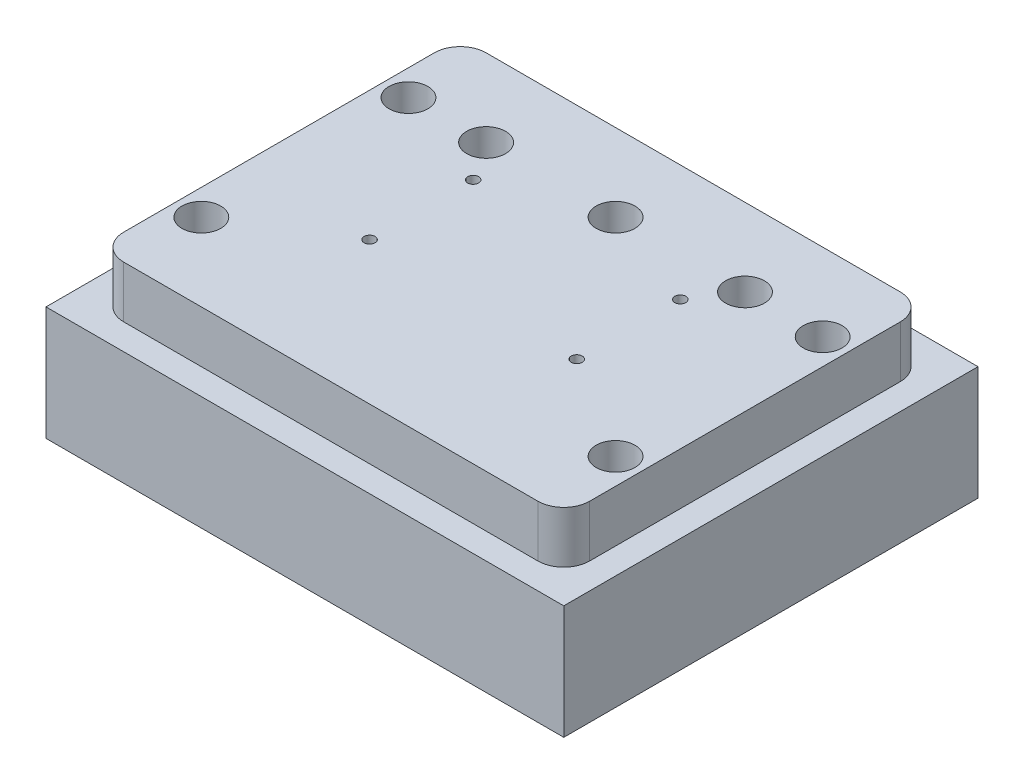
ISO-10303-21;
HEADER;
FILE_DESCRIPTION(('STEP AP214'),'2;1');
FILE_NAME('part.step','',(''),(''),'','','');
FILE_SCHEMA(('AUTOMOTIVE_DESIGN { 1 0 10303 214 1 1 1 1 }'));
ENDSEC;
DATA;
#1=APPLICATION_CONTEXT('core data for automotive mechanical design processes');
#2=APPLICATION_PROTOCOL_DEFINITION('international standard','automotive_design',2000,#1);
#3=PRODUCT_CONTEXT('',#1,'mechanical');
#4=PRODUCT('Part','Part','',(#3));
#5=PRODUCT_RELATED_PRODUCT_CATEGORY('part','',(#4));
#6=PRODUCT_DEFINITION_FORMATION('','',#4);
#7=PRODUCT_DEFINITION_CONTEXT('part definition',#1,'design');
#8=PRODUCT_DEFINITION('design','',#6,#7);
#9=PRODUCT_DEFINITION_SHAPE('','',#8);
#10=(LENGTH_UNIT() NAMED_UNIT(*) SI_UNIT(.MILLI.,.METRE.));
#11=(NAMED_UNIT(*) PLANE_ANGLE_UNIT() SI_UNIT($,.RADIAN.));
#12=(NAMED_UNIT(*) SI_UNIT($,.STERADIAN.) SOLID_ANGLE_UNIT());
#13=UNCERTAINTY_MEASURE_WITH_UNIT(LENGTH_MEASURE(1.E-05),#10,'distance_accuracy_value','');
#14=(GEOMETRIC_REPRESENTATION_CONTEXT(3) GLOBAL_UNCERTAINTY_ASSIGNED_CONTEXT((#13)) GLOBAL_UNIT_ASSIGNED_CONTEXT((#10,
#11,#12)) REPRESENTATION_CONTEXT('',''));
#15=CARTESIAN_POINT('',(0.,0.,0.));
#16=DIRECTION('',(0.,0.,1.));
#17=DIRECTION('',(1.,0.,0.));
#18=AXIS2_PLACEMENT_3D('',#15,#16,#17);
#19=CARTESIAN_POINT('',(-40.4464246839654,40.64,-14.4484109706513));
#20=DIRECTION('',(1.,0.,0.));
#21=DIRECTION('',(0.,0.,-1.));
#22=AXIS2_PLACEMENT_3D('',#19,#20,#21);
#23=PLANE('',#22);
#24=DIRECTION('',(0.,0.,1.));
#25=VECTOR('',#24,1.);
#26=CARTESIAN_POINT('',(-40.4464246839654,27.94,-14.4484109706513));
#27=LINE('',#26,#25);
#28=CARTESIAN_POINT('',(-40.4464246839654,27.94,-8.0984109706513));
#29=VERTEX_POINT('',#28);
#30=CARTESIAN_POINT('',(-40.4464246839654,27.94,68.1015890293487));
#31=VERTEX_POINT('',#30);
#32=EDGE_CURVE('E253',#29,#31,#27,.T.);
#33=ORIENTED_EDGE('',*,*,#32,.T.);
#34=DIRECTION('',(0.,1.,0.));
#35=VECTOR('',#34,1.);
#36=CARTESIAN_POINT('',(-40.4464246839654,27.94,68.1015890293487));
#37=LINE('',#36,#35);
#38=CARTESIAN_POINT('',(-40.4464246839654,40.64,68.1015890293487));
#39=VERTEX_POINT('',#38);
#40=EDGE_CURVE('E1072',#31,#39,#37,.T.);
#41=ORIENTED_EDGE('',*,*,#40,.T.);
#42=DIRECTION('',(0.,0.,1.));
#43=VECTOR('',#42,1.);
#44=CARTESIAN_POINT('',(-40.4464246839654,40.64,-14.4484109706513));
#45=LINE('',#44,#43);
#46=CARTESIAN_POINT('',(-40.4464246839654,40.64,-8.0984109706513));
#47=VERTEX_POINT('',#46);
#48=EDGE_CURVE('E250',#47,#39,#45,.T.);
#49=ORIENTED_EDGE('',*,*,#48,.F.);
#50=DIRECTION('',(0.,1.,0.));
#51=VECTOR('',#50,1.);
#52=CARTESIAN_POINT('',(-40.4464246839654,27.94,-8.0984109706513));
#53=LINE('',#52,#51);
#54=EDGE_CURVE('E1073',#29,#47,#53,.T.);
#55=ORIENTED_EDGE('',*,*,#54,.F.);
#56=EDGE_LOOP('',(#33,#41,#49,#55));
#57=FACE_BOUND('',#56,.T.);
#58=ADVANCED_FACE('F43',(#57),#23,.F.);
#59=CARTESIAN_POINT('',(-40.4464246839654,40.64,74.4515890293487));
#60=DIRECTION('',(0.,0.,-1.));
#61=DIRECTION('',(-1.,0.,0.));
#62=AXIS2_PLACEMENT_3D('',#59,#60,#61);
#63=PLANE('',#62);
#64=DIRECTION('',(0.,1.,0.));
#65=VECTOR('',#64,1.);
#66=CARTESIAN_POINT('',(-34.0964246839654,27.94,74.4515890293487));
#67=LINE('',#66,#65);
#68=CARTESIAN_POINT('',(-34.0964246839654,27.94,74.4515890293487));
#69=VERTEX_POINT('',#68);
#70=CARTESIAN_POINT('',(-34.0964246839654,40.64,74.4515890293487));
#71=VERTEX_POINT('',#70);
#72=EDGE_CURVE('E1081',#69,#71,#67,.T.);
#73=ORIENTED_EDGE('',*,*,#72,.F.);
#74=DIRECTION('',(1.,0.,0.));
#75=VECTOR('',#74,1.);
#76=CARTESIAN_POINT('',(-40.4464246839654,27.94,74.4515890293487));
#77=LINE('',#76,#75);
#78=CARTESIAN_POINT('',(67.5035753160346,27.94,74.4515890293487));
#79=VERTEX_POINT('',#78);
#80=EDGE_CURVE('E248',#69,#79,#77,.T.);
#81=ORIENTED_EDGE('',*,*,#80,.T.);
#82=DIRECTION('',(0.,1.,0.));
#83=VECTOR('',#82,1.);
#84=CARTESIAN_POINT('',(67.5035753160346,27.94,74.4515890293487));
#85=LINE('',#84,#83);
#86=CARTESIAN_POINT('',(67.5035753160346,40.64,74.4515890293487));
#87=VERTEX_POINT('',#86);
#88=EDGE_CURVE('E1086',#79,#87,#85,.T.);
#89=ORIENTED_EDGE('',*,*,#88,.T.);
#90=DIRECTION('',(1.,0.,0.));
#91=VECTOR('',#90,1.);
#92=CARTESIAN_POINT('',(-40.4464246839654,40.64,74.4515890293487));
#93=LINE('',#92,#91);
#94=EDGE_CURVE('E1063',#71,#87,#93,.T.);
#95=ORIENTED_EDGE('',*,*,#94,.F.);
#96=EDGE_LOOP('',(#73,#81,#89,#95));
#97=FACE_BOUND('',#96,.T.);
#98=ADVANCED_FACE('F326',(#97),#63,.F.);
#99=CARTESIAN_POINT('',(73.8535753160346,40.64,-14.4484109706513));
#100=DIRECTION('',(-1.,0.,0.));
#101=DIRECTION('',(0.,0.,1.));
#102=AXIS2_PLACEMENT_3D('',#99,#100,#101);
#103=PLANE('',#102);
#104=DIRECTION('',(0.,1.,0.));
#105=VECTOR('',#104,1.);
#106=CARTESIAN_POINT('',(73.8535753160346,27.94,68.1015890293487));
#107=LINE('',#106,#105);
#108=CARTESIAN_POINT('',(73.8535753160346,27.94,68.1015890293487));
#109=VERTEX_POINT('',#108);
#110=CARTESIAN_POINT('',(73.8535753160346,40.64,68.1015890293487));
#111=VERTEX_POINT('',#110);
#112=EDGE_CURVE('E68',#109,#111,#107,.T.);
#113=ORIENTED_EDGE('',*,*,#112,.F.);
#114=DIRECTION('',(0.,0.,-1.));
#115=VECTOR('',#114,1.);
#116=CARTESIAN_POINT('',(73.8535753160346,27.94,-14.4484109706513));
#117=LINE('',#116,#115);
#118=CARTESIAN_POINT('',(73.8535753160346,27.94,-8.0984109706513));
#119=VERTEX_POINT('',#118);
#120=EDGE_CURVE('E242',#109,#119,#117,.T.);
#121=ORIENTED_EDGE('',*,*,#120,.T.);
#122=DIRECTION('',(0.,1.,0.));
#123=VECTOR('',#122,1.);
#124=CARTESIAN_POINT('',(73.8535753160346,27.94,-8.0984109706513));
#125=LINE('',#124,#123);
#126=CARTESIAN_POINT('',(73.8535753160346,40.64,-8.0984109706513));
#127=VERTEX_POINT('',#126);
#128=EDGE_CURVE('E225',#119,#127,#125,.T.);
#129=ORIENTED_EDGE('',*,*,#128,.T.);
#130=DIRECTION('',(0.,0.,-1.));
#131=VECTOR('',#130,1.);
#132=CARTESIAN_POINT('',(73.8535753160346,40.64,-14.4484109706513));
#133=LINE('',#132,#131);
#134=EDGE_CURVE('E1066',#111,#127,#133,.T.);
#135=ORIENTED_EDGE('',*,*,#134,.F.);
#136=EDGE_LOOP('',(#113,#121,#129,#135));
#137=FACE_BOUND('',#136,.T.);
#138=ADVANCED_FACE('F247',(#137),#103,.F.);
#139=CARTESIAN_POINT('',(-40.4464246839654,40.64,-14.4484109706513));
#140=DIRECTION('',(0.,0.,1.));
#141=DIRECTION('',(1.,0.,0.));
#142=AXIS2_PLACEMENT_3D('',#139,#140,#141);
#143=PLANE('',#142);
#144=DIRECTION('',(0.,1.,0.));
#145=VECTOR('',#144,1.);
#146=CARTESIAN_POINT('',(67.5035753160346,27.94,-14.4484109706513));
#147=LINE('',#146,#145);
#148=CARTESIAN_POINT('',(67.5035753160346,27.94,-14.4484109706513));
#149=VERTEX_POINT('',#148);
#150=CARTESIAN_POINT('',(67.5035753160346,40.64,-14.4484109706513));
#151=VERTEX_POINT('',#150);
#152=EDGE_CURVE('E60',#149,#151,#147,.T.);
#153=ORIENTED_EDGE('',*,*,#152,.F.);
#154=DIRECTION('',(-1.,0.,0.));
#155=VECTOR('',#154,1.);
#156=CARTESIAN_POINT('',(-40.4464246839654,27.94,-14.4484109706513));
#157=LINE('',#156,#155);
#158=CARTESIAN_POINT('',(-34.0964246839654,27.94,-14.4484109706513));
#159=VERTEX_POINT('',#158);
#160=EDGE_CURVE('E245',#149,#159,#157,.T.);
#161=ORIENTED_EDGE('',*,*,#160,.T.);
#162=DIRECTION('',(0.,1.,0.));
#163=VECTOR('',#162,1.);
#164=CARTESIAN_POINT('',(-34.0964246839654,27.94,-14.4484109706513));
#165=LINE('',#164,#163);
#166=CARTESIAN_POINT('',(-34.0964246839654,40.64,-14.4484109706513));
#167=VERTEX_POINT('',#166);
#168=EDGE_CURVE('E1092',#159,#167,#165,.T.);
#169=ORIENTED_EDGE('',*,*,#168,.T.);
#170=DIRECTION('',(-1.,0.,0.));
#171=VECTOR('',#170,1.);
#172=CARTESIAN_POINT('',(-40.4464246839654,40.64,-14.4484109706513));
#173=LINE('',#172,#171);
#174=EDGE_CURVE('E272',#151,#167,#173,.T.);
#175=ORIENTED_EDGE('',*,*,#174,.F.);
#176=EDGE_LOOP('',(#153,#161,#169,#175));
#177=FACE_BOUND('',#176,.T.);
#178=ADVANCED_FACE('F562',(#177),#143,.F.);
#179=CARTESIAN_POINT('',(0.,40.64,0.));
#180=DIRECTION('',(0.,1.,0.));
#181=DIRECTION('',(0.,0.,1.));
#182=AXIS2_PLACEMENT_3D('',#179,#180,#181);
#183=PLANE('',#182);
#184=CARTESIAN_POINT('',(-8.69642468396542,40.64,14.1265890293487));
#185=DIRECTION('',(0.,1.,0.));
#186=DIRECTION('',(0.,0.,1.));
#187=AXIS2_PLACEMENT_3D('',#184,#185,#186);
#188=CIRCLE('',#187,1.35255);
#189=CARTESIAN_POINT('',(-8.69642468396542,40.64,15.4791390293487));
#190=VERTEX_POINT('',#189);
#191=EDGE_CURVE('E1188',#190,#190,#188,.T.);
#192=ORIENTED_EDGE('',*,*,#191,.F.);
#193=EDGE_LOOP('',(#192));
#194=FACE_BOUND('',#193,.T.);
#195=CARTESIAN_POINT('',(42.1035753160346,40.64,14.1265890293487));
#196=DIRECTION('',(0.,1.,0.));
#197=DIRECTION('',(0.,0.,1.));
#198=AXIS2_PLACEMENT_3D('',#195,#196,#197);
#199=CIRCLE('',#198,1.35254999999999);
#200=CARTESIAN_POINT('',(42.1035753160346,40.64,15.4791390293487));
#201=VERTEX_POINT('',#200);
#202=EDGE_CURVE('E1194',#201,#201,#199,.T.);
#203=ORIENTED_EDGE('',*,*,#202,.F.);
#204=EDGE_LOOP('',(#203));
#205=FACE_BOUND('',#204,.T.);
#206=CARTESIAN_POINT('',(42.1035753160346,40.64,39.5265890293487));
#207=DIRECTION('',(0.,1.,0.));
#208=DIRECTION('',(0.,0.,1.));
#209=AXIS2_PLACEMENT_3D('',#206,#207,#208);
#210=CIRCLE('',#209,1.35254999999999);
#211=CARTESIAN_POINT('',(42.1035753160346,40.64,40.8791390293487));
#212=VERTEX_POINT('',#211);
#213=EDGE_CURVE('E1200',#212,#212,#210,.T.);
#214=ORIENTED_EDGE('',*,*,#213,.F.);
#215=EDGE_LOOP('',(#214));
#216=FACE_BOUND('',#215,.T.);
#217=CARTESIAN_POINT('',(-8.69642468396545,40.64,39.5265890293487));
#218=DIRECTION('',(0.,1.,0.));
#219=DIRECTION('',(0.,0.,1.));
#220=AXIS2_PLACEMENT_3D('',#217,#218,#219);
#221=CIRCLE('',#220,1.35255);
#222=CARTESIAN_POINT('',(-8.69642468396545,40.64,40.8791390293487));
#223=VERTEX_POINT('',#222);
#224=EDGE_CURVE('E1206',#223,#223,#221,.T.);
#225=ORIENTED_EDGE('',*,*,#224,.F.);
#226=EDGE_LOOP('',(#225));
#227=FACE_BOUND('',#226,.T.);
#228=CARTESIAN_POINT('',(-15.0464246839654,40.64,4.6015890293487));
#229=DIRECTION('',(0.,1.,0.));
#230=DIRECTION('',(0.,0.,1.));
#231=AXIS2_PLACEMENT_3D('',#228,#229,#230);
#232=CIRCLE('',#231,4.76249999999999);
#233=CARTESIAN_POINT('',(-15.0464246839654,40.64,9.36408902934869));
#234=VERTEX_POINT('',#233);
#235=EDGE_CURVE('E297',#234,#234,#232,.T.);
#236=ORIENTED_EDGE('',*,*,#235,.F.);
#237=EDGE_LOOP('',(#236));
#238=FACE_BOUND('',#237,.T.);
#239=CARTESIAN_POINT('',(16.7035753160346,40.64,4.60158902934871));
#240=DIRECTION('',(0.,1.,0.));
#241=DIRECTION('',(0.,0.,1.));
#242=AXIS2_PLACEMENT_3D('',#239,#240,#241);
#243=CIRCLE('',#242,4.76249999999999);
#244=CARTESIAN_POINT('',(16.7035753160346,40.64,9.3640890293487));
#245=VERTEX_POINT('',#244);
#246=EDGE_CURVE('E1219',#245,#245,#243,.T.);
#247=ORIENTED_EDGE('',*,*,#246,.F.);
#248=EDGE_LOOP('',(#247));
#249=FACE_BOUND('',#248,.T.);
#250=CARTESIAN_POINT('',(48.4535753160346,40.64,4.60158902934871));
#251=DIRECTION('',(0.,1.,0.));
#252=DIRECTION('',(0.,0.,1.));
#253=AXIS2_PLACEMENT_3D('',#250,#251,#252);
#254=CIRCLE('',#253,4.76249999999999);
#255=CARTESIAN_POINT('',(48.4535753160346,40.64,9.3640890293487));
#256=VERTEX_POINT('',#255);
#257=EDGE_CURVE('E1225',#256,#256,#254,.T.);
#258=ORIENTED_EDGE('',*,*,#257,.F.);
#259=EDGE_LOOP('',(#258));
#260=FACE_BOUND('',#259,.T.);
#261=CARTESIAN_POINT('',(-34.0964246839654,40.64,4.6015890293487));
#262=DIRECTION('',(0.,1.,0.));
#263=DIRECTION('',(0.,0.,1.));
#264=AXIS2_PLACEMENT_3D('',#261,#262,#263);
#265=CIRCLE('',#264,4.7625);
#266=CARTESIAN_POINT('',(-34.0964246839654,40.64,9.3640890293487));
#267=VERTEX_POINT('',#266);
#268=EDGE_CURVE('E1231',#267,#267,#265,.T.);
#269=ORIENTED_EDGE('',*,*,#268,.F.);
#270=EDGE_LOOP('',(#269));
#271=FACE_BOUND('',#270,.T.);
#272=CARTESIAN_POINT('',(67.5035753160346,40.64,4.60158902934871));
#273=DIRECTION('',(0.,1.,0.));
#274=DIRECTION('',(0.,0.,1.));
#275=AXIS2_PLACEMENT_3D('',#272,#273,#274);
#276=CIRCLE('',#275,4.7625);
#277=CARTESIAN_POINT('',(67.5035753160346,40.64,9.36408902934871));
#278=VERTEX_POINT('',#277);
#279=EDGE_CURVE('E1237',#278,#278,#276,.T.);
#280=ORIENTED_EDGE('',*,*,#279,.F.);
#281=EDGE_LOOP('',(#280));
#282=FACE_BOUND('',#281,.T.);
#283=CARTESIAN_POINT('',(-34.0964246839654,40.64,55.4015890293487));
#284=DIRECTION('',(0.,1.,0.));
#285=DIRECTION('',(0.,0.,1.));
#286=AXIS2_PLACEMENT_3D('',#283,#284,#285);
#287=CIRCLE('',#286,4.7625);
#288=CARTESIAN_POINT('',(-34.0964246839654,40.64,60.1640890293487));
#289=VERTEX_POINT('',#288);
#290=EDGE_CURVE('E1057',#289,#289,#287,.T.);
#291=ORIENTED_EDGE('',*,*,#290,.F.);
#292=EDGE_LOOP('',(#291));
#293=FACE_BOUND('',#292,.T.);
#294=CARTESIAN_POINT('',(67.5035753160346,40.64,55.4015890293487));
#295=DIRECTION('',(0.,1.,0.));
#296=DIRECTION('',(0.,0.,1.));
#297=AXIS2_PLACEMENT_3D('',#294,#295,#296);
#298=CIRCLE('',#297,4.7625);
#299=CARTESIAN_POINT('',(67.5035753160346,40.64,60.1640890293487));
#300=VERTEX_POINT('',#299);
#301=EDGE_CURVE('E1051',#300,#300,#298,.T.);
#302=ORIENTED_EDGE('',*,*,#301,.F.);
#303=EDGE_LOOP('',(#302));
#304=FACE_BOUND('',#303,.T.);
#305=ORIENTED_EDGE('',*,*,#48,.T.);
#306=CARTESIAN_POINT('',(-34.0964246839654,40.64,68.1015890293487));
#307=DIRECTION('',(0.,1.,0.));
#308=DIRECTION('',(0.,0.,1.));
#309=AXIS2_PLACEMENT_3D('',#306,#307,#308);
#310=CIRCLE('',#309,6.35);
#311=EDGE_CURVE('E1079',#39,#71,#310,.T.);
#312=ORIENTED_EDGE('',*,*,#311,.T.);
#313=ORIENTED_EDGE('',*,*,#94,.T.);
#314=CARTESIAN_POINT('',(67.5035753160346,40.64,68.1015890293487));
#315=DIRECTION('',(0.,1.,0.));
#316=DIRECTION('',(0.,0.,1.));
#317=AXIS2_PLACEMENT_3D('',#314,#315,#316);
#318=CIRCLE('',#317,6.34999999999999);
#319=EDGE_CURVE('E1089',#87,#111,#318,.T.);
#320=ORIENTED_EDGE('',*,*,#319,.T.);
#321=ORIENTED_EDGE('',*,*,#134,.T.);
#322=CARTESIAN_POINT('',(67.5035753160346,40.64,-8.0984109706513));
#323=DIRECTION('',(0.,1.,0.));
#324=DIRECTION('',(0.,0.,1.));
#325=AXIS2_PLACEMENT_3D('',#322,#323,#324);
#326=CIRCLE('',#325,6.35);
#327=EDGE_CURVE('E229',#127,#151,#326,.T.);
#328=ORIENTED_EDGE('',*,*,#327,.T.);
#329=ORIENTED_EDGE('',*,*,#174,.T.);
#330=CARTESIAN_POINT('',(-34.0964246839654,40.64,-8.0984109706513));
#331=DIRECTION('',(0.,1.,0.));
#332=DIRECTION('',(0.,0.,1.));
#333=AXIS2_PLACEMENT_3D('',#330,#331,#332);
#334=CIRCLE('',#333,6.35);
#335=EDGE_CURVE('E1093',#167,#47,#334,.T.);
#336=ORIENTED_EDGE('',*,*,#335,.T.);
#337=EDGE_LOOP('',(#305,#312,#313,#320,#321,#328,#329,#336));
#338=FACE_BOUND('',#337,.T.);
#339=ADVANCED_FACE('F379',(#194,#205,#216,#227,#238,#249,#260,#271,#282,#293,#304,#338),#183,.T.);
#340=CARTESIAN_POINT('',(-15.0464246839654,12.7,-20.7984109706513));
#341=DIRECTION('',(0.,0.,-1.));
#342=DIRECTION('',(-1.,0.,0.));
#343=AXIS2_PLACEMENT_3D('',#340,#341,#342);
#344=CYLINDRICAL_SURFACE('',#343,4.76249999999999);
#345=CARTESIAN_POINT('',(-15.0464246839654,12.7,4.6015890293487));
#346=DIRECTION('',(0.,0.707106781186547,0.707106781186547));
#347=DIRECTION('',(0.,0.707106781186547,-0.707106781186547));
#348=AXIS2_PLACEMENT_3D('',#345,#346,#347);
#349=ELLIPSE('',#348,6.73519209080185,4.76249999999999);
#350=CARTESIAN_POINT('',(-19.8089246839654,12.7,4.6015890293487));
#351=VERTEX_POINT('',#350);
#352=CARTESIAN_POINT('',(-10.2839246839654,12.7,4.6015890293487));
#353=VERTEX_POINT('',#352);
#354=EDGE_CURVE('E288',#351,#353,#349,.F.);
#355=ORIENTED_EDGE('',*,*,#354,.F.);
#356=CARTESIAN_POINT('',(-15.0464246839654,12.7,4.6015890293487));
#357=DIRECTION('',(0.,0.707106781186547,-0.707106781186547));
#358=DIRECTION('',(0.,0.707106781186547,0.707106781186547));
#359=AXIS2_PLACEMENT_3D('',#356,#357,#358);
#360=ELLIPSE('',#359,6.73519209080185,4.76249999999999);
#361=EDGE_CURVE('E1315',#353,#351,#360,.T.);
#362=ORIENTED_EDGE('',*,*,#361,.F.);
#363=EDGE_LOOP('',(#355,#362));
#364=FACE_BOUND('',#363,.T.);
#365=CARTESIAN_POINT('',(-15.0464246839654,12.7,-8.0984109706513));
#366=DIRECTION('',(0.,0.,-1.));
#367=DIRECTION('',(-1.,0.,0.));
#368=AXIS2_PLACEMENT_3D('',#365,#366,#367);
#369=CIRCLE('',#368,4.76249999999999);
#370=CARTESIAN_POINT('',(-19.8089246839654,12.7,-8.0984109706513));
#371=VERTEX_POINT('',#370);
#372=EDGE_CURVE('E47',#371,#371,#369,.F.);
#373=ORIENTED_EDGE('',*,*,#372,.F.);
#374=EDGE_LOOP('',(#373));
#375=FACE_BOUND('',#374,.T.);
#376=ADVANCED_FACE('F312',(#364,#375),#344,.F.);
#377=CARTESIAN_POINT('',(48.4535753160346,12.7,-20.7984109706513));
#378=DIRECTION('',(0.,0.,-1.));
#379=DIRECTION('',(-1.,0.,0.));
#380=AXIS2_PLACEMENT_3D('',#377,#378,#379);
#381=CYLINDRICAL_SURFACE('',#380,4.76249999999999);
#382=CARTESIAN_POINT('',(48.4535753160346,12.7,4.60158902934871));
#383=DIRECTION('',(0.,0.707106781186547,0.707106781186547));
#384=DIRECTION('',(0.,0.707106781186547,-0.707106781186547));
#385=AXIS2_PLACEMENT_3D('',#382,#383,#384);
#386=ELLIPSE('',#385,6.73519209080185,4.76249999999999);
#387=CARTESIAN_POINT('',(43.6910753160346,12.7,4.6015890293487));
#388=VERTEX_POINT('',#387);
#389=CARTESIAN_POINT('',(53.2160753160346,12.7,4.6015890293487));
#390=VERTEX_POINT('',#389);
#391=EDGE_CURVE('E52',#388,#390,#386,.F.);
#392=ORIENTED_EDGE('',*,*,#391,.F.);
#393=CARTESIAN_POINT('',(48.4535753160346,12.7,4.60158902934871));
#394=DIRECTION('',(0.,0.707106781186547,-0.707106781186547));
#395=DIRECTION('',(0.,0.707106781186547,0.707106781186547));
#396=AXIS2_PLACEMENT_3D('',#393,#394,#395);
#397=ELLIPSE('',#396,6.73519209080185,4.76249999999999);
#398=EDGE_CURVE('E11',#390,#388,#397,.T.);
#399=ORIENTED_EDGE('',*,*,#398,.F.);
#400=EDGE_LOOP('',(#392,#399));
#401=FACE_BOUND('',#400,.T.);
#402=CARTESIAN_POINT('',(48.4535753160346,12.7,-8.0984109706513));
#403=DIRECTION('',(0.,0.,-1.));
#404=DIRECTION('',(-1.,0.,0.));
#405=AXIS2_PLACEMENT_3D('',#402,#403,#404);
#406=CIRCLE('',#405,4.76249999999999);
#407=CARTESIAN_POINT('',(43.6910753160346,12.7,-8.0984109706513));
#408=VERTEX_POINT('',#407);
#409=EDGE_CURVE('E1151',#408,#408,#406,.F.);
#410=ORIENTED_EDGE('',*,*,#409,.F.);
#411=EDGE_LOOP('',(#410));
#412=FACE_BOUND('',#411,.T.);
#413=ADVANCED_FACE('F358',(#401,#412),#381,.F.);
#414=CARTESIAN_POINT('',(-46.7964246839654,27.94,-20.7984109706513));
#415=DIRECTION('',(1.,0.,0.));
#416=DIRECTION('',(0.,0.,-1.));
#417=AXIS2_PLACEMENT_3D('',#414,#415,#416);
#418=PLANE('',#417);
#419=DIRECTION('',(0.,0.,1.));
#420=VECTOR('',#419,1.);
#421=CARTESIAN_POINT('',(-46.7964246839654,0.,-20.7984109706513));
#422=LINE('',#421,#420);
#423=CARTESIAN_POINT('',(-46.7964246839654,0.,-20.7984109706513));
#424=VERTEX_POINT('',#423);
#425=CARTESIAN_POINT('',(-46.7964246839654,0.,80.8015890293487));
#426=VERTEX_POINT('',#425);
#427=EDGE_CURVE('E268',#424,#426,#422,.T.);
#428=ORIENTED_EDGE('',*,*,#427,.T.);
#429=DIRECTION('',(0.,-1.,0.));
#430=VECTOR('',#429,1.);
#431=CARTESIAN_POINT('',(-46.7964246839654,27.94,80.8015890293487));
#432=LINE('',#431,#430);
#433=CARTESIAN_POINT('',(-46.7964246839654,27.94,80.8015890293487));
#434=VERTEX_POINT('',#433);
#435=EDGE_CURVE('E285',#434,#426,#432,.T.);
#436=ORIENTED_EDGE('',*,*,#435,.F.);
#437=DIRECTION('',(0.,0.,1.));
#438=VECTOR('',#437,1.);
#439=CARTESIAN_POINT('',(-46.7964246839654,27.94,-20.7984109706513));
#440=LINE('',#439,#438);
#441=CARTESIAN_POINT('',(-46.7964246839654,27.94,-20.7984109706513));
#442=VERTEX_POINT('',#441);
#443=EDGE_CURVE('E257',#442,#434,#440,.T.);
#444=ORIENTED_EDGE('',*,*,#443,.F.);
#445=DIRECTION('',(0.,-1.,0.));
#446=VECTOR('',#445,1.);
#447=CARTESIAN_POINT('',(-46.7964246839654,27.94,-20.7984109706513));
#448=LINE('',#447,#446);
#449=EDGE_CURVE('E267',#442,#424,#448,.T.);
#450=ORIENTED_EDGE('',*,*,#449,.T.);
#451=EDGE_LOOP('',(#428,#436,#444,#450));
#452=FACE_BOUND('',#451,.T.);
#453=ADVANCED_FACE('F45',(#452),#418,.F.);
#454=CARTESIAN_POINT('',(-46.7964246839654,27.94,80.8015890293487));
#455=DIRECTION('',(0.,0.,-1.));
#456=DIRECTION('',(-1.,0.,0.));
#457=AXIS2_PLACEMENT_3D('',#454,#455,#456);
#458=PLANE('',#457);
#459=DIRECTION('',(1.,0.,0.));
#460=VECTOR('',#459,1.);
#461=CARTESIAN_POINT('',(-46.7964246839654,0.,80.8015890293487));
#462=LINE('',#461,#460);
#463=CARTESIAN_POINT('',(80.2035753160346,0.,80.8015890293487));
#464=VERTEX_POINT('',#463);
#465=EDGE_CURVE('E271',#426,#464,#462,.T.);
#466=ORIENTED_EDGE('',*,*,#465,.T.);
#467=DIRECTION('',(0.,-1.,0.));
#468=VECTOR('',#467,1.);
#469=CARTESIAN_POINT('',(80.2035753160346,27.94,80.8015890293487));
#470=LINE('',#469,#468);
#471=CARTESIAN_POINT('',(80.2035753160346,27.94,80.8015890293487));
#472=VERTEX_POINT('',#471);
#473=EDGE_CURVE('E282',#472,#464,#470,.T.);
#474=ORIENTED_EDGE('',*,*,#473,.F.);
#475=DIRECTION('',(1.,0.,0.));
#476=VECTOR('',#475,1.);
#477=CARTESIAN_POINT('',(-46.7964246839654,27.94,80.8015890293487));
#478=LINE('',#477,#476);
#479=EDGE_CURVE('E260',#434,#472,#478,.T.);
#480=ORIENTED_EDGE('',*,*,#479,.F.);
#481=ORIENTED_EDGE('',*,*,#435,.T.);
#482=EDGE_LOOP('',(#466,#474,#480,#481));
#483=FACE_BOUND('',#482,.T.);
#484=ADVANCED_FACE('F351',(#483),#458,.F.);
#485=CARTESIAN_POINT('',(80.2035753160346,27.94,-20.7984109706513));
#486=DIRECTION('',(-1.,0.,0.));
#487=DIRECTION('',(0.,0.,1.));
#488=AXIS2_PLACEMENT_3D('',#485,#486,#487);
#489=PLANE('',#488);
#490=DIRECTION('',(0.,0.,-1.));
#491=VECTOR('',#490,1.);
#492=CARTESIAN_POINT('',(80.2035753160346,0.,-20.7984109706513));
#493=LINE('',#492,#491);
#494=CARTESIAN_POINT('',(80.2035753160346,0.,-20.7984109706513));
#495=VERTEX_POINT('',#494);
#496=EDGE_CURVE('E274',#464,#495,#493,.T.);
#497=ORIENTED_EDGE('',*,*,#496,.T.);
#498=DIRECTION('',(0.,-1.,0.));
#499=VECTOR('',#498,1.);
#500=CARTESIAN_POINT('',(80.2035753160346,27.94,-20.7984109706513));
#501=LINE('',#500,#499);
#502=CARTESIAN_POINT('',(80.2035753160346,27.94,-20.7984109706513));
#503=VERTEX_POINT('',#502);
#504=EDGE_CURVE('E279',#503,#495,#501,.T.);
#505=ORIENTED_EDGE('',*,*,#504,.F.);
#506=DIRECTION('',(0.,0.,-1.));
#507=VECTOR('',#506,1.);
#508=CARTESIAN_POINT('',(80.2035753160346,27.94,-20.7984109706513));
#509=LINE('',#508,#507);
#510=EDGE_CURVE('E263',#472,#503,#509,.T.);
#511=ORIENTED_EDGE('',*,*,#510,.F.);
#512=ORIENTED_EDGE('',*,*,#473,.T.);
#513=EDGE_LOOP('',(#497,#505,#511,#512));
#514=FACE_BOUND('',#513,.T.);
#515=ADVANCED_FACE('F348',(#514),#489,.F.);
#516=CARTESIAN_POINT('',(-46.7964246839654,27.94,-20.7984109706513));
#517=DIRECTION('',(0.,0.,1.));
#518=DIRECTION('',(1.,0.,0.));
#519=AXIS2_PLACEMENT_3D('',#516,#517,#518);
#520=PLANE('',#519);
#521=CARTESIAN_POINT('',(65.1159753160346,12.7,-20.7984109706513));
#522=DIRECTION('',(0.,0.,-1.));
#523=DIRECTION('',(-1.,0.,0.));
#524=AXIS2_PLACEMENT_3D('',#521,#522,#523);
#525=CIRCLE('',#524,1.1303);
#526=CARTESIAN_POINT('',(63.9856753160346,12.7,-20.7984109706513));
#527=VERTEX_POINT('',#526);
#528=EDGE_CURVE('E1097',#527,#527,#525,.T.);
#529=ORIENTED_EDGE('',*,*,#528,.F.);
#530=EDGE_LOOP('',(#529));
#531=FACE_BOUND('',#530,.T.);
#532=CARTESIAN_POINT('',(31.7911753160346,12.7,-20.7984109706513));
#533=DIRECTION('',(0.,0.,-1.));
#534=DIRECTION('',(-1.,0.,0.));
#535=AXIS2_PLACEMENT_3D('',#532,#533,#534);
#536=CIRCLE('',#535,1.1303);
#537=CARTESIAN_POINT('',(30.6608753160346,12.7,-20.7984109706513));
#538=VERTEX_POINT('',#537);
#539=EDGE_CURVE('E1105',#538,#538,#536,.T.);
#540=ORIENTED_EDGE('',*,*,#539,.F.);
#541=EDGE_LOOP('',(#540));
#542=FACE_BOUND('',#541,.T.);
#543=CARTESIAN_POINT('',(-2.54962468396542,12.7,-20.7984109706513));
#544=DIRECTION('',(0.,0.,-1.));
#545=DIRECTION('',(-1.,0.,0.));
#546=AXIS2_PLACEMENT_3D('',#543,#544,#545);
#547=CIRCLE('',#546,1.1303);
#548=CARTESIAN_POINT('',(-3.67992468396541,12.7,-20.7984109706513));
#549=VERTEX_POINT('',#548);
#550=EDGE_CURVE('E1111',#549,#549,#547,.T.);
#551=ORIENTED_EDGE('',*,*,#550,.F.);
#552=EDGE_LOOP('',(#551));
#553=FACE_BOUND('',#552,.T.);
#554=CARTESIAN_POINT('',(-27.5432246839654,12.7,-20.7984109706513));
#555=DIRECTION('',(0.,0.,-1.));
#556=DIRECTION('',(-1.,0.,0.));
#557=AXIS2_PLACEMENT_3D('',#554,#555,#556);
#558=CIRCLE('',#557,1.1303);
#559=CARTESIAN_POINT('',(-28.6735246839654,12.7,-20.7984109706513));
#560=VERTEX_POINT('',#559);
#561=EDGE_CURVE('E1117',#560,#560,#558,.T.);
#562=ORIENTED_EDGE('',*,*,#561,.F.);
#563=EDGE_LOOP('',(#562));
#564=FACE_BOUND('',#563,.T.);
#565=DIRECTION('',(-1.,0.,0.));
#566=VECTOR('',#565,1.);
#567=CARTESIAN_POINT('',(63.0585753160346,6.985,-20.7984109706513));
#568=LINE('',#567,#566);
#569=CARTESIAN_POINT('',(63.0585753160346,6.985,-20.7984109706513));
#570=VERTEX_POINT('',#569);
#571=CARTESIAN_POINT('',(33.8485753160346,6.985,-20.7984109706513));
#572=VERTEX_POINT('',#571);
#573=EDGE_CURVE('E1140',#570,#572,#568,.T.);
#574=ORIENTED_EDGE('',*,*,#573,.F.);
#575=DIRECTION('',(0.,-1.,0.));
#576=VECTOR('',#575,1.);
#577=CARTESIAN_POINT('',(63.0585753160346,18.415,-20.7984109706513));
#578=LINE('',#577,#576);
#579=CARTESIAN_POINT('',(63.0585753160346,18.415,-20.7984109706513));
#580=VERTEX_POINT('',#579);
#581=EDGE_CURVE('E1138',#580,#570,#578,.T.);
#582=ORIENTED_EDGE('',*,*,#581,.F.);
#583=DIRECTION('',(1.,0.,0.));
#584=VECTOR('',#583,1.);
#585=CARTESIAN_POINT('',(63.0585753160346,18.415,-20.7984109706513));
#586=LINE('',#585,#584);
#587=CARTESIAN_POINT('',(33.8485753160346,18.415,-20.7984109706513));
#588=VERTEX_POINT('',#587);
#589=EDGE_CURVE('E1128',#588,#580,#586,.T.);
#590=ORIENTED_EDGE('',*,*,#589,.F.);
#591=DIRECTION('',(0.,1.,0.));
#592=VECTOR('',#591,1.);
#593=CARTESIAN_POINT('',(33.8485753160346,18.415,-20.7984109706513));
#594=LINE('',#593,#592);
#595=EDGE_CURVE('E1144',#572,#588,#594,.T.);
#596=ORIENTED_EDGE('',*,*,#595,.F.);
#597=EDGE_LOOP('',(#574,#582,#590,#596));
#598=FACE_BOUND('',#597,.T.);
#599=DIRECTION('',(-1.,0.,0.));
#600=VECTOR('',#599,1.);
#601=CARTESIAN_POINT('',(-4.63242468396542,6.985,-20.7984109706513));
#602=LINE('',#601,#600);
#603=CARTESIAN_POINT('',(-4.63242468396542,6.985,-20.7984109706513));
#604=VERTEX_POINT('',#603);
#605=CARTESIAN_POINT('',(-25.4604246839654,6.985,-20.7984109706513));
#606=VERTEX_POINT('',#605);
#607=EDGE_CURVE('E1174',#604,#606,#602,.T.);
#608=ORIENTED_EDGE('',*,*,#607,.F.);
#609=DIRECTION('',(0.,-1.,0.));
#610=VECTOR('',#609,1.);
#611=CARTESIAN_POINT('',(-4.63242468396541,18.415,-20.7984109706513));
#612=LINE('',#611,#610);
#613=CARTESIAN_POINT('',(-4.63242468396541,18.415,-20.7984109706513));
#614=VERTEX_POINT('',#613);
#615=EDGE_CURVE('E1141',#614,#604,#612,.T.);
#616=ORIENTED_EDGE('',*,*,#615,.F.);
#617=DIRECTION('',(1.,0.,0.));
#618=VECTOR('',#617,1.);
#619=CARTESIAN_POINT('',(-4.63242468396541,18.415,-20.7984109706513));
#620=LINE('',#619,#618);
#621=CARTESIAN_POINT('',(-25.4604246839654,18.415,-20.7984109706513));
#622=VERTEX_POINT('',#621);
#623=EDGE_CURVE('E1167',#622,#614,#620,.T.);
#624=ORIENTED_EDGE('',*,*,#623,.F.);
#625=DIRECTION('',(0.,1.,0.));
#626=VECTOR('',#625,1.);
#627=CARTESIAN_POINT('',(-25.4604246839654,18.415,-20.7984109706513));
#628=LINE('',#627,#626);
#629=EDGE_CURVE('E1170',#606,#622,#628,.T.);
#630=ORIENTED_EDGE('',*,*,#629,.F.);
#631=EDGE_LOOP('',(#608,#616,#624,#630));
#632=FACE_BOUND('',#631,.T.);
#633=CARTESIAN_POINT('',(16.7035753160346,12.7,-20.7984109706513));
#634=DIRECTION('',(0.,0.,-1.));
#635=DIRECTION('',(-1.,0.,0.));
#636=AXIS2_PLACEMENT_3D('',#633,#634,#635);
#637=CIRCLE('',#636,4.21639999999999);
#638=CARTESIAN_POINT('',(12.4871753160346,12.7,-20.7984109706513));
#639=VERTEX_POINT('',#638);
#640=EDGE_CURVE('E298',#639,#639,#637,.T.);
#641=ORIENTED_EDGE('',*,*,#640,.F.);
#642=EDGE_LOOP('',(#641));
#643=FACE_BOUND('',#642,.T.);
#644=DIRECTION('',(-1.,0.,0.));
#645=VECTOR('',#644,1.);
#646=CARTESIAN_POINT('',(-46.7964246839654,0.,-20.7984109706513));
#647=LINE('',#646,#645);
#648=EDGE_CURVE('E261',#495,#424,#647,.T.);
#649=ORIENTED_EDGE('',*,*,#648,.T.);
#650=ORIENTED_EDGE('',*,*,#449,.F.);
#651=DIRECTION('',(-1.,0.,0.));
#652=VECTOR('',#651,1.);
#653=CARTESIAN_POINT('',(-46.7964246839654,27.94,-20.7984109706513));
#654=LINE('',#653,#652);
#655=EDGE_CURVE('E265',#503,#442,#654,.T.);
#656=ORIENTED_EDGE('',*,*,#655,.F.);
#657=ORIENTED_EDGE('',*,*,#504,.T.);
#658=EDGE_LOOP('',(#649,#650,#656,#657));
#659=FACE_BOUND('',#658,.T.);
#660=ADVANCED_FACE('F341',(#531,#542,#553,#564,#598,#632,#643,#659),#520,.F.);
#661=CARTESIAN_POINT('',(0.,27.94,0.));
#662=DIRECTION('',(0.,1.,0.));
#663=DIRECTION('',(0.,0.,1.));
#664=AXIS2_PLACEMENT_3D('',#661,#662,#663);
#665=PLANE('',#664);
#666=ORIENTED_EDGE('',*,*,#32,.F.);
#667=CARTESIAN_POINT('',(-34.0964246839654,27.94,-8.0984109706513));
#668=DIRECTION('',(0.,1.,0.));
#669=DIRECTION('',(0.,0.,1.));
#670=AXIS2_PLACEMENT_3D('',#667,#668,#669);
#671=CIRCLE('',#670,6.35);
#672=EDGE_CURVE('E1075',#159,#29,#671,.T.);
#673=ORIENTED_EDGE('',*,*,#672,.F.);
#674=ORIENTED_EDGE('',*,*,#160,.F.);
#675=CARTESIAN_POINT('',(67.5035753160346,27.94,-8.0984109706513));
#676=DIRECTION('',(0.,1.,0.));
#677=DIRECTION('',(0.,0.,1.));
#678=AXIS2_PLACEMENT_3D('',#675,#676,#677);
#679=CIRCLE('',#678,6.35);
#680=EDGE_CURVE('E228',#119,#149,#679,.T.);
#681=ORIENTED_EDGE('',*,*,#680,.F.);
#682=ORIENTED_EDGE('',*,*,#120,.F.);
#683=CARTESIAN_POINT('',(67.5035753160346,27.94,68.1015890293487));
#684=DIRECTION('',(0.,1.,0.));
#685=DIRECTION('',(0.,0.,1.));
#686=AXIS2_PLACEMENT_3D('',#683,#684,#685);
#687=CIRCLE('',#686,6.34999999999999);
#688=EDGE_CURVE('E1252',#79,#109,#687,.T.);
#689=ORIENTED_EDGE('',*,*,#688,.F.);
#690=ORIENTED_EDGE('',*,*,#80,.F.);
#691=CARTESIAN_POINT('',(-34.0964246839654,27.94,68.1015890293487));
#692=DIRECTION('',(0.,1.,0.));
#693=DIRECTION('',(0.,0.,1.));
#694=AXIS2_PLACEMENT_3D('',#691,#692,#693);
#695=CIRCLE('',#694,6.35);
#696=EDGE_CURVE('E1077',#31,#69,#695,.T.);
#697=ORIENTED_EDGE('',*,*,#696,.F.);
#698=EDGE_LOOP('',(#666,#673,#674,#681,#682,#689,#690,#697));
#699=FACE_BOUND('',#698,.T.);
#700=ORIENTED_EDGE('',*,*,#443,.T.);
#701=ORIENTED_EDGE('',*,*,#479,.T.);
#702=ORIENTED_EDGE('',*,*,#510,.T.);
#703=ORIENTED_EDGE('',*,*,#655,.T.);
#704=EDGE_LOOP('',(#700,#701,#702,#703));
#705=FACE_BOUND('',#704,.T.);
#706=ADVANCED_FACE('F239',(#699,#705),#665,.T.);
#707=CARTESIAN_POINT('',(0.,0.,0.));
#708=DIRECTION('',(0.,1.,0.));
#709=DIRECTION('',(0.,0.,1.));
#710=AXIS2_PLACEMENT_3D('',#707,#708,#709);
#711=PLANE('',#710);
#712=CARTESIAN_POINT('',(-34.0964246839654,0.,4.6015890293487));
#713=DIRECTION('',(0.,1.,0.));
#714=DIRECTION('',(0.,0.,1.));
#715=AXIS2_PLACEMENT_3D('',#712,#713,#714);
#716=CIRCLE('',#715,4.7625);
#717=CARTESIAN_POINT('',(-34.0964246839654,0.,9.3640890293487));
#718=VERTEX_POINT('',#717);
#719=EDGE_CURVE('E1234',#718,#718,#716,.T.);
#720=ORIENTED_EDGE('',*,*,#719,.T.);
#721=EDGE_LOOP('',(#720));
#722=FACE_BOUND('',#721,.T.);
#723=CARTESIAN_POINT('',(67.5035753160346,0.,4.60158902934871));
#724=DIRECTION('',(0.,1.,0.));
#725=DIRECTION('',(0.,0.,1.));
#726=AXIS2_PLACEMENT_3D('',#723,#724,#725);
#727=CIRCLE('',#726,4.76249999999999);
#728=CARTESIAN_POINT('',(67.5035753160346,0.,9.3640890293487));
#729=VERTEX_POINT('',#728);
#730=EDGE_CURVE('E1240',#729,#729,#727,.T.);
#731=ORIENTED_EDGE('',*,*,#730,.T.);
#732=EDGE_LOOP('',(#731));
#733=FACE_BOUND('',#732,.T.);
#734=CARTESIAN_POINT('',(-34.0964246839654,0.,55.4015890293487));
#735=DIRECTION('',(0.,1.,0.));
#736=DIRECTION('',(0.,0.,1.));
#737=AXIS2_PLACEMENT_3D('',#734,#735,#736);
#738=CIRCLE('',#737,4.7625);
#739=CARTESIAN_POINT('',(-34.0964246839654,0.,60.1640890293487));
#740=VERTEX_POINT('',#739);
#741=EDGE_CURVE('E1053',#740,#740,#738,.T.);
#742=ORIENTED_EDGE('',*,*,#741,.T.);
#743=EDGE_LOOP('',(#742));
#744=FACE_BOUND('',#743,.T.);
#745=CARTESIAN_POINT('',(67.5035753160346,0.,55.4015890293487));
#746=DIRECTION('',(0.,1.,0.));
#747=DIRECTION('',(0.,0.,1.));
#748=AXIS2_PLACEMENT_3D('',#745,#746,#747);
#749=CIRCLE('',#748,4.76249999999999);
#750=CARTESIAN_POINT('',(67.5035753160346,0.,60.1640890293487));
#751=VERTEX_POINT('',#750);
#752=EDGE_CURVE('E1048',#751,#751,#749,.T.);
#753=ORIENTED_EDGE('',*,*,#752,.T.);
#754=EDGE_LOOP('',(#753));
#755=FACE_BOUND('',#754,.T.);
#756=ORIENTED_EDGE('',*,*,#427,.F.);
#757=ORIENTED_EDGE('',*,*,#648,.F.);
#758=ORIENTED_EDGE('',*,*,#496,.F.);
#759=ORIENTED_EDGE('',*,*,#465,.F.);
#760=EDGE_LOOP('',(#756,#757,#758,#759));
#761=FACE_BOUND('',#760,.T.);
#762=ADVANCED_FACE('F340',(#722,#733,#744,#755,#761),#711,.F.);
#763=CARTESIAN_POINT('',(67.5035753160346,40.64,55.4015890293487));
#764=DIRECTION('',(0.,1.,0.));
#765=DIRECTION('',(0.,0.,1.));
#766=AXIS2_PLACEMENT_3D('',#763,#764,#765);
#767=CYLINDRICAL_SURFACE('',#766,4.7625);
#768=ORIENTED_EDGE('',*,*,#752,.F.);
#769=EDGE_LOOP('',(#768));
#770=FACE_BOUND('',#769,.T.);
#771=ORIENTED_EDGE('',*,*,#301,.T.);
#772=EDGE_LOOP('',(#771));
#773=FACE_BOUND('',#772,.T.);
#774=ADVANCED_FACE('F344',(#770,#773),#767,.F.);
#775=CARTESIAN_POINT('',(-34.0964246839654,40.64,55.4015890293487));
#776=DIRECTION('',(0.,1.,0.));
#777=DIRECTION('',(0.,0.,1.));
#778=AXIS2_PLACEMENT_3D('',#775,#776,#777);
#779=CYLINDRICAL_SURFACE('',#778,4.7625);
#780=ORIENTED_EDGE('',*,*,#741,.F.);
#781=EDGE_LOOP('',(#780));
#782=FACE_BOUND('',#781,.T.);
#783=ORIENTED_EDGE('',*,*,#290,.T.);
#784=EDGE_LOOP('',(#783));
#785=FACE_BOUND('',#784,.T.);
#786=ADVANCED_FACE('F865',(#782,#785),#779,.F.);
#787=CARTESIAN_POINT('',(67.5035753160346,40.64,4.60158902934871));
#788=DIRECTION('',(0.,1.,0.));
#789=DIRECTION('',(0.,0.,1.));
#790=AXIS2_PLACEMENT_3D('',#787,#788,#789);
#791=CYLINDRICAL_SURFACE('',#790,4.7625);
#792=ORIENTED_EDGE('',*,*,#730,.F.);
#793=EDGE_LOOP('',(#792));
#794=FACE_BOUND('',#793,.T.);
#795=ORIENTED_EDGE('',*,*,#279,.T.);
#796=EDGE_LOOP('',(#795));
#797=FACE_BOUND('',#796,.T.);
#798=ADVANCED_FACE('F854',(#794,#797),#791,.F.);
#799=CARTESIAN_POINT('',(-34.0964246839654,40.64,4.6015890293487));
#800=DIRECTION('',(0.,1.,0.));
#801=DIRECTION('',(0.,0.,1.));
#802=AXIS2_PLACEMENT_3D('',#799,#800,#801);
#803=CYLINDRICAL_SURFACE('',#802,4.7625);
#804=ORIENTED_EDGE('',*,*,#719,.F.);
#805=EDGE_LOOP('',(#804));
#806=FACE_BOUND('',#805,.T.);
#807=ORIENTED_EDGE('',*,*,#268,.T.);
#808=EDGE_LOOP('',(#807));
#809=FACE_BOUND('',#808,.T.);
#810=ADVANCED_FACE('F843',(#806,#809),#803,.F.);
#811=CARTESIAN_POINT('',(48.4535753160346,7.62,4.60158902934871));
#812=DIRECTION('',(0.,1.,0.));
#813=DIRECTION('',(0.,0.,1.));
#814=AXIS2_PLACEMENT_3D('',#811,#812,#813);
#815=CONICAL_SURFACE('',#814,4.76249999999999,1.02974425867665);
#816=CARTESIAN_POINT('',(48.4535753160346,4.75840130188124,4.60158902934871));
#817=VERTEX_POINT('',#816);
#818=VERTEX_LOOP('',#817);
#819=FACE_BOUND('',#818,.T.);
#820=CARTESIAN_POINT('',(48.4535753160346,7.62,4.60158902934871));
#821=DIRECTION('',(0.,1.,0.));
#822=DIRECTION('',(0.,0.,1.));
#823=AXIS2_PLACEMENT_3D('',#820,#821,#822);
#824=CIRCLE('',#823,4.76249999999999);
#825=CARTESIAN_POINT('',(48.4535753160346,7.62,9.3640890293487));
#826=VERTEX_POINT('',#825);
#827=EDGE_CURVE('E1228',#826,#826,#824,.T.);
#828=ORIENTED_EDGE('',*,*,#827,.T.);
#829=EDGE_LOOP('',(#828));
#830=FACE_BOUND('',#829,.T.);
#831=ADVANCED_FACE('F833',(#819,#830),#815,.F.);
#832=CARTESIAN_POINT('',(48.4535753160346,40.64,4.60158902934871));
#833=DIRECTION('',(0.,1.,0.));
#834=DIRECTION('',(0.,0.,1.));
#835=AXIS2_PLACEMENT_3D('',#832,#833,#834);
#836=CYLINDRICAL_SURFACE('',#835,4.76249999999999);
#837=ORIENTED_EDGE('',*,*,#391,.T.);
#838=ORIENTED_EDGE('',*,*,#398,.T.);
#839=EDGE_LOOP('',(#837,#838));
#840=FACE_BOUND('',#839,.T.);
#841=ORIENTED_EDGE('',*,*,#827,.F.);
#842=EDGE_LOOP('',(#841));
#843=FACE_BOUND('',#842,.T.);
#844=ORIENTED_EDGE('',*,*,#257,.T.);
#845=EDGE_LOOP('',(#844));
#846=FACE_BOUND('',#845,.T.);
#847=ADVANCED_FACE('F823',(#840,#843,#846),#836,.F.);
#848=CARTESIAN_POINT('',(16.7035753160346,7.62,4.60158902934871));
#849=DIRECTION('',(0.,1.,0.));
#850=DIRECTION('',(0.,0.,1.));
#851=AXIS2_PLACEMENT_3D('',#848,#849,#850);
#852=CONICAL_SURFACE('',#851,4.76249999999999,1.02974425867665);
#853=CARTESIAN_POINT('',(16.7035753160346,4.75840130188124,4.60158902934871));
#854=VERTEX_POINT('',#853);
#855=VERTEX_LOOP('',#854);
#856=FACE_BOUND('',#855,.T.);
#857=CARTESIAN_POINT('',(16.7035753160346,7.62,4.60158902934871));
#858=DIRECTION('',(0.,1.,0.));
#859=DIRECTION('',(0.,0.,1.));
#860=AXIS2_PLACEMENT_3D('',#857,#858,#859);
#861=CIRCLE('',#860,4.76249999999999);
#862=CARTESIAN_POINT('',(16.7035753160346,7.62,9.3640890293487));
#863=VERTEX_POINT('',#862);
#864=EDGE_CURVE('E1222',#863,#863,#861,.T.);
#865=ORIENTED_EDGE('',*,*,#864,.T.);
#866=EDGE_LOOP('',(#865));
#867=FACE_BOUND('',#866,.T.);
#868=ADVANCED_FACE('F322',(#856,#867),#852,.F.);
#869=CARTESIAN_POINT('',(16.7035753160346,40.64,4.60158902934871));
#870=DIRECTION('',(0.,1.,0.));
#871=DIRECTION('',(0.,0.,1.));
#872=AXIS2_PLACEMENT_3D('',#869,#870,#871);
#873=CYLINDRICAL_SURFACE('',#872,4.76249999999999);
#874=CARTESIAN_POINT('',(12.4871753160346,12.7,2.38723194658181));
#875=CARTESIAN_POINT('',(12.4871738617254,12.7660040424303,2.38723667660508));
#876=CARTESIAN_POINT('',(12.488729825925,12.8319928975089,2.38426443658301));
#877=CARTESIAN_POINT('',(12.4948918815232,12.9633250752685,2.37259093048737));
#878=CARTESIAN_POINT('',(12.4994989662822,13.0286681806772,2.3638877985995));
#879=CARTESIAN_POINT('',(12.5177371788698,13.2231954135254,2.32984015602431));
#880=CARTESIAN_POINT('',(12.5357844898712,13.3506266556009,2.29656037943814));
#881=CARTESIAN_POINT('',(12.5757672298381,13.5647167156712,2.22592964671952));
#882=CARTESIAN_POINT('',(12.5953361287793,13.6530921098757,2.19210576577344));
#883=CARTESIAN_POINT('',(12.6393680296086,13.8261468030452,2.11855314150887));
#884=CARTESIAN_POINT('',(12.663834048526,13.9108237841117,2.07882076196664));
#885=CARTESIAN_POINT('',(12.717350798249,14.0768371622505,1.99507876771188));
#886=CARTESIAN_POINT('',(12.746415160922,14.1581626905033,1.95105658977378));
#887=CARTESIAN_POINT('',(12.8088363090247,14.3175153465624,1.86015479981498));
#888=CARTESIAN_POINT('',(12.8421944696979,14.3955414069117,1.81327427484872));
#889=CARTESIAN_POINT('',(12.9355873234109,14.5971928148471,1.68729315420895));
#890=CARTESIAN_POINT('',(12.9990968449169,14.7182641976,1.60666045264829));
#891=CARTESIAN_POINT('',(13.1369557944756,14.9529475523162,1.44373295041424));
#892=CARTESIAN_POINT('',(13.2113114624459,15.0665551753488,1.36143721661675));
#893=CARTESIAN_POINT('',(13.3707921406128,15.286307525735,1.19761877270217));
#894=CARTESIAN_POINT('',(13.4559049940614,15.3924604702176,1.11609529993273));
#895=CARTESIAN_POINT('',(13.6370339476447,15.5970696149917,0.955718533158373));
#896=CARTESIAN_POINT('',(13.7330449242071,15.6955293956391,0.876864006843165));
#897=CARTESIAN_POINT('',(13.9898875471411,15.9340084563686,0.683030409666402));
#898=CARTESIAN_POINT('',(14.158183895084,16.0685318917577,0.570953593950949));
#899=CARTESIAN_POINT('',(14.5204251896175,16.3138037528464,0.363819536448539));
#900=CARTESIAN_POINT('',(14.7143255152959,16.4245926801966,0.26873334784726));
#901=CARTESIAN_POINT('',(15.0866220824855,16.5983551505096,0.118393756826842));
#902=CARTESIAN_POINT('',(15.2609178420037,16.6664186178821,0.0590018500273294));
#903=CARTESIAN_POINT('',(15.5316497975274,16.7513705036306,-0.015422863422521));
#904=CARTESIAN_POINT('',(15.6234683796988,16.7768352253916,-0.0377913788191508));
#905=CARTESIAN_POINT('',(15.8096792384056,16.821666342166,-0.0772351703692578));
#906=CARTESIAN_POINT('',(15.904070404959,16.8410353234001,-0.0943126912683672));
#907=CARTESIAN_POINT('',(16.0953710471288,16.873438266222,-0.122911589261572));
#908=CARTESIAN_POINT('',(16.1922923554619,16.8864329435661,-0.134398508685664));
#909=CARTESIAN_POINT('',(16.3872837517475,16.9056607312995,-0.151403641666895));
#910=CARTESIAN_POINT('',(16.4853533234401,16.9118967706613,-0.15692444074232));
#911=CARTESIAN_POINT('',(16.681850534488,16.917488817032,-0.161874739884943));
#912=CARTESIAN_POINT('',(16.7802781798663,16.9168447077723,-0.161304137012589));
#913=CARTESIAN_POINT('',(16.9765953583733,16.9087003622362,-0.154095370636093));
#914=CARTESIAN_POINT('',(17.0744849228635,16.9012005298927,-0.147457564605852));
#915=CARTESIAN_POINT('',(17.348579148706,16.8705591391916,-0.120364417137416));
#916=CARTESIAN_POINT('',(17.5233326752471,16.8396404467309,-0.09304739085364));
#917=CARTESIAN_POINT('',(17.863969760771,16.7573782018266,-0.0206744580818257));
#918=CARTESIAN_POINT('',(18.0298510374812,16.7060294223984,0.0243859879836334));
#919=CARTESIAN_POINT('',(18.3599905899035,16.5816689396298,0.132837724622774));
#920=CARTESIAN_POINT('',(18.5234851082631,16.507494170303,0.197206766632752));
#921=CARTESIAN_POINT('',(18.8351709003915,16.3421850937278,0.339297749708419));
#922=CARTESIAN_POINT('',(18.9833593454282,16.2510476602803,0.417022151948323));
#923=CARTESIAN_POINT('',(19.3369277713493,16.0032338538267,0.625652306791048));
#924=CARTESIAN_POINT('',(19.5319073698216,15.8371418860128,0.763175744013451));
#925=CARTESIAN_POINT('',(19.7968092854,15.5680844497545,0.978547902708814));
#926=CARTESIAN_POINT('',(19.8807145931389,15.4747843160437,1.05207561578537));
#927=CARTESIAN_POINT('',(20.0393564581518,15.281892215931,1.2007432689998));
#928=CARTESIAN_POINT('',(20.1140966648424,15.1823027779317,1.27588255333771));
#929=CARTESIAN_POINT('',(20.2561496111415,14.9745264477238,1.42799322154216));
#930=CARTESIAN_POINT('',(20.3232438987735,14.8661915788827,1.5049657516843));
#931=CARTESIAN_POINT('',(20.4479422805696,14.6427129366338,1.65697026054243));
#932=CARTESIAN_POINT('',(20.5055387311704,14.5275637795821,1.73200063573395));
#933=CARTESIAN_POINT('',(20.6106116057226,14.2905409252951,1.87680981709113));
#934=CARTESIAN_POINT('',(20.6581422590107,14.1687079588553,1.9466153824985));
#935=CARTESIAN_POINT('',(20.7427147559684,13.916952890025,2.07715311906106));
#936=CARTESIAN_POINT('',(20.7797772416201,13.7870473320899,2.13790303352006));
#937=CARTESIAN_POINT('',(20.8374201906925,13.5384884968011,2.23611003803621));
#938=CARTESIAN_POINT('',(20.8596424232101,13.421087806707,2.27569735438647));
#939=CARTESIAN_POINT('',(20.8942211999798,13.1807851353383,2.33858028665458));
#940=CARTESIAN_POINT('',(20.9066104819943,13.0579028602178,2.3619299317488));
#941=CARTESIAN_POINT('',(20.9204621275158,12.8079620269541,2.38809869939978));
#942=CARTESIAN_POINT('',(20.9218147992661,12.6808741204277,2.39071171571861));
#943=CARTESIAN_POINT('',(20.9131236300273,12.4284217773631,2.37422144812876));
#944=CARTESIAN_POINT('',(20.9030609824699,12.3030605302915,2.35508232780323));
#945=CARTESIAN_POINT('',(20.8689102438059,12.027908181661,2.29228220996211));
#946=CARTESIAN_POINT('',(20.8419953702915,11.8796345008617,2.24377123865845));
#947=CARTESIAN_POINT('',(20.7747445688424,11.5929941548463,2.12947222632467));
#948=CARTESIAN_POINT('',(20.734358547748,11.4546668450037,2.06361989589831));
#949=CARTESIAN_POINT('',(20.6464500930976,11.2006838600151,1.92933110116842));
#950=CARTESIAN_POINT('',(20.6000395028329,11.0841424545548,1.861805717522));
#951=CARTESIAN_POINT('',(20.4982195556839,10.8576836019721,1.72243327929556));
#952=CARTESIAN_POINT('',(20.442803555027,10.7477711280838,1.65058305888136));
#953=CARTESIAN_POINT('',(20.3231384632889,10.5339397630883,1.50496617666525));
#954=CARTESIAN_POINT('',(20.2588765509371,10.4300298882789,1.4311968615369));
#955=CARTESIAN_POINT('',(20.1216231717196,10.2281858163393,1.28368192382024));
#956=CARTESIAN_POINT('',(20.0486340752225,10.1302500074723,1.20993630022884));
#957=CARTESIAN_POINT('',(19.8890923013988,9.93460688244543,1.05946588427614));
#958=CARTESIAN_POINT('',(19.8019832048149,9.83727958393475,0.982834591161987));
#959=CARTESIAN_POINT('',(19.6176713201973,9.64986046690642,0.832825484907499));
#960=CARTESIAN_POINT('',(19.5204662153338,9.55977031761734,0.759448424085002));
#961=CARTESIAN_POINT('',(19.3161749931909,9.38788528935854,0.617730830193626));
#962=CARTESIAN_POINT('',(19.2091189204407,9.30606668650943,0.549376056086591));
#963=CARTESIAN_POINT('',(18.9850214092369,9.15153851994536,0.419097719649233));
#964=CARTESIAN_POINT('',(18.8679813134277,9.07882773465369,0.357173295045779));
#965=CARTESIAN_POINT('',(18.5829245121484,8.92101572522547,0.221870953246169));
#966=CARTESIAN_POINT('',(18.4110223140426,8.83999857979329,0.151667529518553));
#967=CARTESIAN_POINT('',(18.141994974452,8.73537222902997,0.0605137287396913));
#968=CARTESIAN_POINT('',(18.0504349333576,8.70330801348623,0.0324829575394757));
#969=CARTESIAN_POINT('',(17.8640184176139,8.6452605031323,-0.0183776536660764));
#970=CARTESIAN_POINT('',(17.769163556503,8.61927427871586,-0.0412099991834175));
#971=CARTESIAN_POINT('',(17.5759778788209,8.57363682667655,-0.0813728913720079));
#972=CARTESIAN_POINT('',(17.4776256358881,8.55403688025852,-0.0986588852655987));
#973=CARTESIAN_POINT('',(17.2789485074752,8.5218312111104,-0.127090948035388));
#974=CARTESIAN_POINT('',(17.1786245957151,8.5092221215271,-0.138239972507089));
#975=CARTESIAN_POINT('',(16.9768410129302,8.49124571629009,-0.154141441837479));
#976=CARTESIAN_POINT('',(16.8753815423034,8.48587714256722,-0.158894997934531));
#977=CARTESIAN_POINT('',(16.6722499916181,8.48249306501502,-0.161890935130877));
#978=CARTESIAN_POINT('',(16.5705779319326,8.48447688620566,-0.160133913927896));
#979=CARTESIAN_POINT('',(16.3791157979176,8.49513276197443,-0.150703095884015));
#980=CARTESIAN_POINT('',(16.2892490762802,8.50304501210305,-0.143701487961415));
#981=CARTESIAN_POINT('',(16.1107158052,8.52451850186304,-0.12472020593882));
#982=CARTESIAN_POINT('',(16.0220496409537,8.53808151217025,-0.112738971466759));
#983=CARTESIAN_POINT('',(15.7588064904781,8.58694721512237,-0.0696352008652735));
#984=CARTESIAN_POINT('',(15.5868214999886,8.63043617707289,-0.0313440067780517));
#985=CARTESIAN_POINT('',(15.2497512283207,8.7381089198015,0.062947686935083));
#986=CARTESIAN_POINT('',(15.0849431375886,8.80277954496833,0.119364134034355));
#987=CARTESIAN_POINT('',(14.7691696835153,8.94947319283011,0.246305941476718));
#988=CARTESIAN_POINT('',(14.6182101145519,9.03150343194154,0.316837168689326));
#989=CARTESIAN_POINT('',(14.2607146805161,9.25413252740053,0.506180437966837));
#990=CARTESIAN_POINT('',(14.0632524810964,9.40372019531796,0.631701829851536));
#991=CARTESIAN_POINT('',(13.7925563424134,9.64732316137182,0.830641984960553));
#992=CARTESIAN_POINT('',(13.7064343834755,9.73190711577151,0.89887177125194));
#993=CARTESIAN_POINT('',(13.5425835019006,9.90705852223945,1.03773721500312));
#994=CARTESIAN_POINT('',(13.4648532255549,9.99762500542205,1.10837248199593));
#995=CARTESIAN_POINT('',(13.3161178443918,10.1864505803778,1.25233711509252));
#996=CARTESIAN_POINT('',(13.2452962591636,10.2848343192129,1.32569164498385));
#997=CARTESIAN_POINT('',(13.1122433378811,10.4875204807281,1.47212855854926));
#998=CARTESIAN_POINT('',(13.0500152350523,10.5918251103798,1.54521082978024));
#999=CARTESIAN_POINT('',(12.9343435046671,10.8063907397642,1.68906568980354));
#1000=CARTESIAN_POINT('',(12.8808835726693,10.9166401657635,1.75984236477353));
#1001=CARTESIAN_POINT('',(12.7829189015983,11.1437977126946,1.89660834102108));
#1002=CARTESIAN_POINT('',(12.7384061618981,11.2606997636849,1.96260188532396));
#1003=CARTESIAN_POINT('',(12.6580211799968,11.5048292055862,2.08752472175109));
#1004=CARTESIAN_POINT('',(12.6223667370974,11.632230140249,2.14626085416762));
#1005=CARTESIAN_POINT('',(12.5624812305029,11.8953768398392,2.24865726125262));
#1006=CARTESIAN_POINT('',(12.5382107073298,12.0310919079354,2.29236946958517));
#1007=CARTESIAN_POINT('',(12.5096421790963,12.2566670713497,2.34485245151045));
#1008=CARTESIAN_POINT('',(12.501259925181,12.3443787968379,2.36058819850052));
#1009=CARTESIAN_POINT('',(12.490029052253,12.5214035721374,2.38177181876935));
#1010=CARTESIAN_POINT('',(12.487177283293,12.6107156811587,2.38722554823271));
#1011=CARTESIAN_POINT('',(12.4871753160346,12.7,2.38723194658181));
#1012=B_SPLINE_CURVE_WITH_KNOTS('',3,(#874,#875,#876,#877,#878,#879,#880,#881,#882,#883,#884,
#885,#886,#887,#888,#889,#890,#891,#892,#893,#894,#895,#896,#897,#898,#899,#900,#901,#902,#903,
#904,#905,#906,#907,#908,#909,#910,#911,#912,#913,#914,#915,#916,#917,#918,#919,#920,#921,#922,
#923,#924,#925,#926,#927,#928,#929,#930,#931,#932,#933,#934,#935,#936,#937,#938,#939,#940,#941,
#942,#943,#944,#945,#946,#947,#948,#949,#950,#951,#952,#953,#954,#955,#956,#957,#958,#959,#960,
#961,#962,#963,#964,#965,#966,#967,#968,#969,#970,#971,#972,#973,#974,#975,#976,#977,#978,#979,
#980,#981,#982,#983,#984,#985,#986,#987,#988,#989,#990,#991,#992,#993,#994,#995,#996,#997,#998,
#999,#1000,#1001,#1002,#1003,#1004,#1005,#1006,#1007,#1008,#1009,#1010,#1011),.UNSPECIFIED.,.T.,
.F.,(4,2,2,2,2,2,2,2,2,2,2,2,2,2,2,2,2,2,2,2,2,2,2,2,2,2,2,2,2,2,2,2,2,2,2,2,2,2,2,2,2,2,2,2,2,
2,2,2,2,2,2,2,2,2,2,2,2,2,2,2,2,2,2,2,2,2,2,2,4),(0.,0.197898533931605,0.395861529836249,
0.792527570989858,1.08206209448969,1.37177554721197,1.6623645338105,1.95304682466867,
2.42856989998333,2.90436763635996,3.37963240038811,3.85467464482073,4.58046495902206,
5.30500670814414,5.89130849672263,6.18462085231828,6.47780859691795,6.77278121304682,
7.06762594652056,7.3624756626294,7.6573080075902,8.19335869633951,8.72954662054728,
9.29958871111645,9.86973596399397,10.7367700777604,11.1727777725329,11.608611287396,
12.0547915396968,12.5013291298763,12.9453960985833,13.3885812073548,13.7650087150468,
14.1401776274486,14.5190708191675,14.8985891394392,15.3708625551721,15.8449120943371,
16.2717331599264,16.6988705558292,17.1266336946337,17.5542809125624,18.0080728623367,
18.4619691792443,18.9145243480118,19.3670187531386,19.9720280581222,20.2746693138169,
20.577164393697,20.882031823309,21.1867522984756,21.4914198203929,21.796059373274,
22.0671845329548,22.3383947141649,22.8803296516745,23.4357151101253,23.9913318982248,
24.8195654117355,25.2352673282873,25.6509020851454,26.0755964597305,26.5004501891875,
26.9245047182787,27.3481783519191,27.781418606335,28.2131458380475,28.4809977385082,
28.7486970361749),.UNSPECIFIED.);
#1013=CARTESIAN_POINT('',(12.4871753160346,12.7,2.38723194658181));
#1014=VERTEX_POINT('',#1013);
#1015=EDGE_CURVE('E289',#1014,#1014,#1012,.T.);
#1016=ORIENTED_EDGE('',*,*,#1015,.T.);
#1017=EDGE_LOOP('',(#1016));
#1018=FACE_BOUND('',#1017,.T.);
#1019=ORIENTED_EDGE('',*,*,#864,.F.);
#1020=EDGE_LOOP('',(#1019));
#1021=FACE_BOUND('',#1020,.T.);
#1022=ORIENTED_EDGE('',*,*,#246,.T.);
#1023=EDGE_LOOP('',(#1022));
#1024=FACE_BOUND('',#1023,.T.);
#1025=ADVANCED_FACE('F300',(#1018,#1021,#1024),#873,.F.);
#1026=CARTESIAN_POINT('',(-15.0464246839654,7.62,4.6015890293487));
#1027=DIRECTION('',(0.,1.,0.));
#1028=DIRECTION('',(0.,0.,1.));
#1029=AXIS2_PLACEMENT_3D('',#1026,#1027,#1028);
#1030=CONICAL_SURFACE('',#1029,4.76249999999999,1.02974425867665);
#1031=CARTESIAN_POINT('',(-15.0464246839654,4.75840130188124,4.6015890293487));
#1032=VERTEX_POINT('',#1031);
#1033=VERTEX_LOOP('',#1032);
#1034=FACE_BOUND('',#1033,.T.);
#1035=CARTESIAN_POINT('',(-15.0464246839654,7.62,4.6015890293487));
#1036=DIRECTION('',(0.,1.,0.));
#1037=DIRECTION('',(0.,0.,1.));
#1038=AXIS2_PLACEMENT_3D('',#1035,#1036,#1037);
#1039=CIRCLE('',#1038,4.76249999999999);
#1040=CARTESIAN_POINT('',(-15.0464246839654,7.62,9.36408902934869));
#1041=VERTEX_POINT('',#1040);
#1042=EDGE_CURVE('E1216',#1041,#1041,#1039,.T.);
#1043=ORIENTED_EDGE('',*,*,#1042,.T.);
#1044=EDGE_LOOP('',(#1043));
#1045=FACE_BOUND('',#1044,.T.);
#1046=ADVANCED_FACE('F315',(#1034,#1045),#1030,.F.);
#1047=CARTESIAN_POINT('',(-15.0464246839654,40.64,4.6015890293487));
#1048=DIRECTION('',(0.,1.,0.));
#1049=DIRECTION('',(0.,0.,1.));
#1050=AXIS2_PLACEMENT_3D('',#1047,#1048,#1049);
#1051=CYLINDRICAL_SURFACE('',#1050,4.76249999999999);
#1052=ORIENTED_EDGE('',*,*,#354,.T.);
#1053=ORIENTED_EDGE('',*,*,#361,.T.);
#1054=EDGE_LOOP('',(#1052,#1053));
#1055=FACE_BOUND('',#1054,.T.);
#1056=ORIENTED_EDGE('',*,*,#1042,.F.);
#1057=EDGE_LOOP('',(#1056));
#1058=FACE_BOUND('',#1057,.T.);
#1059=ORIENTED_EDGE('',*,*,#235,.T.);
#1060=EDGE_LOOP('',(#1059));
#1061=FACE_BOUND('',#1060,.T.);
#1062=ADVANCED_FACE('F310',(#1055,#1058,#1061),#1051,.F.);
#1063=CARTESIAN_POINT('',(16.7035753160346,12.7,-20.7984109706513));
#1064=DIRECTION('',(0.,0.,-1.));
#1065=DIRECTION('',(-1.,0.,0.));
#1066=AXIS2_PLACEMENT_3D('',#1063,#1064,#1065);
#1067=CYLINDRICAL_SURFACE('',#1066,4.21639999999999);
#1068=ORIENTED_EDGE('',*,*,#640,.T.);
#1069=EDGE_LOOP('',(#1068));
#1070=FACE_BOUND('',#1069,.T.);
#1071=ORIENTED_EDGE('',*,*,#1015,.F.);
#1072=EDGE_LOOP('',(#1071));
#1073=FACE_BOUND('',#1072,.T.);
#1074=ADVANCED_FACE('F304',(#1070,#1073),#1067,.F.);
#1075=CARTESIAN_POINT('',(-8.69642468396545,33.02,39.5265890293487));
#1076=DIRECTION('',(0.,1.,0.));
#1077=DIRECTION('',(0.,0.,1.));
#1078=AXIS2_PLACEMENT_3D('',#1075,#1076,#1077);
#1079=CONICAL_SURFACE('',#1078,1.35255,1.02974425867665);
#1080=CARTESIAN_POINT('',(-8.69642468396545,32.2073059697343,39.5265890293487));
#1081=VERTEX_POINT('',#1080);
#1082=VERTEX_LOOP('',#1081);
#1083=FACE_BOUND('',#1082,.T.);
#1084=CARTESIAN_POINT('',(-8.69642468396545,33.02,39.5265890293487));
#1085=DIRECTION('',(0.,1.,0.));
#1086=DIRECTION('',(0.,0.,1.));
#1087=AXIS2_PLACEMENT_3D('',#1084,#1085,#1086);
#1088=CIRCLE('',#1087,1.35255);
#1089=CARTESIAN_POINT('',(-8.69642468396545,33.02,40.8791390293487));
#1090=VERTEX_POINT('',#1089);
#1091=EDGE_CURVE('E1209',#1090,#1090,#1088,.T.);
#1092=ORIENTED_EDGE('',*,*,#1091,.T.);
#1093=EDGE_LOOP('',(#1092));
#1094=FACE_BOUND('',#1093,.T.);
#1095=ADVANCED_FACE('F309',(#1083,#1094),#1079,.F.);
#1096=CARTESIAN_POINT('',(-8.69642468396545,40.64,39.5265890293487));
#1097=DIRECTION('',(0.,1.,0.));
#1098=DIRECTION('',(0.,0.,1.));
#1099=AXIS2_PLACEMENT_3D('',#1096,#1097,#1098);
#1100=CYLINDRICAL_SURFACE('',#1099,1.35255);
#1101=ORIENTED_EDGE('',*,*,#1091,.F.);
#1102=EDGE_LOOP('',(#1101));
#1103=FACE_BOUND('',#1102,.T.);
#1104=ORIENTED_EDGE('',*,*,#224,.T.);
#1105=EDGE_LOOP('',(#1104));
#1106=FACE_BOUND('',#1105,.T.);
#1107=ADVANCED_FACE('F385',(#1103,#1106),#1100,.F.);
#1108=CARTESIAN_POINT('',(42.1035753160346,33.02,39.5265890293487));
#1109=DIRECTION('',(0.,1.,0.));
#1110=DIRECTION('',(0.,0.,1.));
#1111=AXIS2_PLACEMENT_3D('',#1108,#1109,#1110);
#1112=CONICAL_SURFACE('',#1111,1.35255,1.02974425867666);
#1113=CARTESIAN_POINT('',(42.1035753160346,32.2073059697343,39.5265890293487));
#1114=VERTEX_POINT('',#1113);
#1115=VERTEX_LOOP('',#1114);
#1116=FACE_BOUND('',#1115,.T.);
#1117=CARTESIAN_POINT('',(42.1035753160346,33.02,39.5265890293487));
#1118=DIRECTION('',(0.,1.,0.));
#1119=DIRECTION('',(0.,0.,1.));
#1120=AXIS2_PLACEMENT_3D('',#1117,#1118,#1119);
#1121=CIRCLE('',#1120,1.35255);
#1122=CARTESIAN_POINT('',(42.1035753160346,33.02,40.8791390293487));
#1123=VERTEX_POINT('',#1122);
#1124=EDGE_CURVE('E1203',#1123,#1123,#1121,.T.);
#1125=ORIENTED_EDGE('',*,*,#1124,.T.);
#1126=EDGE_LOOP('',(#1125));
#1127=FACE_BOUND('',#1126,.T.);
#1128=ADVANCED_FACE('F389',(#1116,#1127),#1112,.F.);
#1129=CARTESIAN_POINT('',(42.1035753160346,40.64,39.5265890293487));
#1130=DIRECTION('',(0.,1.,0.));
#1131=DIRECTION('',(0.,0.,1.));
#1132=AXIS2_PLACEMENT_3D('',#1129,#1130,#1131);
#1133=CYLINDRICAL_SURFACE('',#1132,1.35255);
#1134=ORIENTED_EDGE('',*,*,#1124,.F.);
#1135=EDGE_LOOP('',(#1134));
#1136=FACE_BOUND('',#1135,.T.);
#1137=ORIENTED_EDGE('',*,*,#213,.T.);
#1138=EDGE_LOOP('',(#1137));
#1139=FACE_BOUND('',#1138,.T.);
#1140=ADVANCED_FACE('F393',(#1136,#1139),#1133,.F.);
#1141=CARTESIAN_POINT('',(42.1035753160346,33.02,14.1265890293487));
#1142=DIRECTION('',(0.,1.,0.));
#1143=DIRECTION('',(0.,0.,1.));
#1144=AXIS2_PLACEMENT_3D('',#1141,#1142,#1143);
#1145=CONICAL_SURFACE('',#1144,1.35255,1.02974425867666);
#1146=CARTESIAN_POINT('',(42.1035753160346,32.2073059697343,14.1265890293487));
#1147=VERTEX_POINT('',#1146);
#1148=VERTEX_LOOP('',#1147);
#1149=FACE_BOUND('',#1148,.T.);
#1150=CARTESIAN_POINT('',(42.1035753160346,33.02,14.1265890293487));
#1151=DIRECTION('',(0.,1.,0.));
#1152=DIRECTION('',(0.,0.,1.));
#1153=AXIS2_PLACEMENT_3D('',#1150,#1151,#1152);
#1154=CIRCLE('',#1153,1.35255);
#1155=CARTESIAN_POINT('',(42.1035753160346,33.02,15.4791390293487));
#1156=VERTEX_POINT('',#1155);
#1157=EDGE_CURVE('E1197',#1156,#1156,#1154,.T.);
#1158=ORIENTED_EDGE('',*,*,#1157,.T.);
#1159=EDGE_LOOP('',(#1158));
#1160=FACE_BOUND('',#1159,.T.);
#1161=ADVANCED_FACE('F397',(#1149,#1160),#1145,.F.);
#1162=CARTESIAN_POINT('',(42.1035753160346,40.64,14.1265890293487));
#1163=DIRECTION('',(0.,1.,0.));
#1164=DIRECTION('',(0.,0.,1.));
#1165=AXIS2_PLACEMENT_3D('',#1162,#1163,#1164);
#1166=CYLINDRICAL_SURFACE('',#1165,1.35255);
#1167=ORIENTED_EDGE('',*,*,#1157,.F.);
#1168=EDGE_LOOP('',(#1167));
#1169=FACE_BOUND('',#1168,.T.);
#1170=ORIENTED_EDGE('',*,*,#202,.T.);
#1171=EDGE_LOOP('',(#1170));
#1172=FACE_BOUND('',#1171,.T.);
#1173=ADVANCED_FACE('F401',(#1169,#1172),#1166,.F.);
#1174=CARTESIAN_POINT('',(-8.69642468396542,33.02,14.1265890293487));
#1175=DIRECTION('',(0.,1.,0.));
#1176=DIRECTION('',(0.,0.,1.));
#1177=AXIS2_PLACEMENT_3D('',#1174,#1175,#1176);
#1178=CONICAL_SURFACE('',#1177,1.35255,1.02974425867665);
#1179=CARTESIAN_POINT('',(-8.69642468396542,32.2073059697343,14.1265890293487));
#1180=VERTEX_POINT('',#1179);
#1181=VERTEX_LOOP('',#1180);
#1182=FACE_BOUND('',#1181,.T.);
#1183=CARTESIAN_POINT('',(-8.69642468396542,33.02,14.1265890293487));
#1184=DIRECTION('',(0.,1.,0.));
#1185=DIRECTION('',(0.,0.,1.));
#1186=AXIS2_PLACEMENT_3D('',#1183,#1184,#1185);
#1187=CIRCLE('',#1186,1.35255);
#1188=CARTESIAN_POINT('',(-8.69642468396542,33.02,15.4791390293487));
#1189=VERTEX_POINT('',#1188);
#1190=EDGE_CURVE('E1191',#1189,#1189,#1187,.T.);
#1191=ORIENTED_EDGE('',*,*,#1190,.T.);
#1192=EDGE_LOOP('',(#1191));
#1193=FACE_BOUND('',#1192,.T.);
#1194=ADVANCED_FACE('F405',(#1182,#1193),#1178,.F.);
#1195=CARTESIAN_POINT('',(-8.69642468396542,40.64,14.1265890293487));
#1196=DIRECTION('',(0.,1.,0.));
#1197=DIRECTION('',(0.,0.,1.));
#1198=AXIS2_PLACEMENT_3D('',#1195,#1196,#1197);
#1199=CYLINDRICAL_SURFACE('',#1198,1.35255);
#1200=ORIENTED_EDGE('',*,*,#1190,.F.);
#1201=EDGE_LOOP('',(#1200));
#1202=FACE_BOUND('',#1201,.T.);
#1203=ORIENTED_EDGE('',*,*,#191,.T.);
#1204=EDGE_LOOP('',(#1203));
#1205=FACE_BOUND('',#1204,.T.);
#1206=ADVANCED_FACE('F409',(#1202,#1205),#1199,.F.);
#1207=CARTESIAN_POINT('',(0.,0.,-8.0984109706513));
#1208=DIRECTION('',(0.,0.,-1.));
#1209=DIRECTION('',(-1.,0.,0.));
#1210=AXIS2_PLACEMENT_3D('',#1207,#1208,#1209);
#1211=PLANE('',#1210);
#1212=DIRECTION('',(0.,-1.,0.));
#1213=VECTOR('',#1212,1.);
#1214=CARTESIAN_POINT('',(63.0585753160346,18.415,-8.0984109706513));
#1215=LINE('',#1214,#1213);
#1216=CARTESIAN_POINT('',(63.0585753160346,18.415,-8.0984109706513));
#1217=VERTEX_POINT('',#1216);
#1218=CARTESIAN_POINT('',(63.0585753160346,6.985,-8.0984109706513));
#1219=VERTEX_POINT('',#1218);
#1220=EDGE_CURVE('E1124',#1217,#1219,#1215,.T.);
#1221=ORIENTED_EDGE('',*,*,#1220,.T.);
#1222=DIRECTION('',(-1.,0.,0.));
#1223=VECTOR('',#1222,1.);
#1224=CARTESIAN_POINT('',(63.0585753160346,6.985,-8.0984109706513));
#1225=LINE('',#1224,#1223);
#1226=CARTESIAN_POINT('',(33.8485753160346,6.985,-8.0984109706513));
#1227=VERTEX_POINT('',#1226);
#1228=EDGE_CURVE('E1127',#1219,#1227,#1225,.T.);
#1229=ORIENTED_EDGE('',*,*,#1228,.T.);
#1230=DIRECTION('',(0.,1.,0.));
#1231=VECTOR('',#1230,1.);
#1232=CARTESIAN_POINT('',(33.8485753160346,18.415,-8.0984109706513));
#1233=LINE('',#1232,#1231);
#1234=CARTESIAN_POINT('',(33.8485753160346,18.415,-8.0984109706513));
#1235=VERTEX_POINT('',#1234);
#1236=EDGE_CURVE('E1131',#1227,#1235,#1233,.T.);
#1237=ORIENTED_EDGE('',*,*,#1236,.T.);
#1238=DIRECTION('',(1.,0.,0.));
#1239=VECTOR('',#1238,1.);
#1240=CARTESIAN_POINT('',(63.0585753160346,18.415,-8.0984109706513));
#1241=LINE('',#1240,#1239);
#1242=EDGE_CURVE('E1134',#1235,#1217,#1241,.T.);
#1243=ORIENTED_EDGE('',*,*,#1242,.T.);
#1244=EDGE_LOOP('',(#1221,#1229,#1237,#1243));
#1245=FACE_BOUND('',#1244,.T.);
#1246=ORIENTED_EDGE('',*,*,#409,.T.);
#1247=EDGE_LOOP('',(#1246));
#1248=FACE_BOUND('',#1247,.T.);
#1249=ADVANCED_FACE('F413',(#1245,#1248),#1211,.T.);
#1250=CARTESIAN_POINT('',(63.0585753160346,18.415,-8.0984109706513));
#1251=DIRECTION('',(1.,0.,0.));
#1252=DIRECTION('',(0.,0.,-1.));
#1253=AXIS2_PLACEMENT_3D('',#1250,#1251,#1252);
#1254=PLANE('',#1253);
#1255=ORIENTED_EDGE('',*,*,#581,.T.);
#1256=DIRECTION('',(0.,0.,-1.));
#1257=VECTOR('',#1256,1.);
#1258=CARTESIAN_POINT('',(63.0585753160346,6.985,-8.0984109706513));
#1259=LINE('',#1258,#1257);
#1260=EDGE_CURVE('E1137',#1219,#570,#1259,.T.);
#1261=ORIENTED_EDGE('',*,*,#1260,.F.);
#1262=ORIENTED_EDGE('',*,*,#1220,.F.);
#1263=DIRECTION('',(0.,0.,-1.));
#1264=VECTOR('',#1263,1.);
#1265=CARTESIAN_POINT('',(63.0585753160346,18.415,-8.0984109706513));
#1266=LINE('',#1265,#1264);
#1267=EDGE_CURVE('E1149',#1217,#580,#1266,.T.);
#1268=ORIENTED_EDGE('',*,*,#1267,.T.);
#1269=EDGE_LOOP('',(#1255,#1261,#1262,#1268));
#1270=FACE_BOUND('',#1269,.T.);
#1271=ADVANCED_FACE('F437',(#1270),#1254,.F.);
#1272=CARTESIAN_POINT('',(63.0585753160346,18.415,-8.0984109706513));
#1273=DIRECTION('',(0.,1.,0.));
#1274=DIRECTION('',(-1.,0.,0.));
#1275=AXIS2_PLACEMENT_3D('',#1272,#1273,#1274);
#1276=PLANE('',#1275);
#1277=ORIENTED_EDGE('',*,*,#589,.T.);
#1278=ORIENTED_EDGE('',*,*,#1267,.F.);
#1279=ORIENTED_EDGE('',*,*,#1242,.F.);
#1280=DIRECTION('',(0.,0.,-1.));
#1281=VECTOR('',#1280,1.);
#1282=CARTESIAN_POINT('',(33.8485753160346,18.415,-8.0984109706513));
#1283=LINE('',#1282,#1281);
#1284=EDGE_CURVE('E1152',#1235,#588,#1283,.T.);
#1285=ORIENTED_EDGE('',*,*,#1284,.T.);
#1286=EDGE_LOOP('',(#1277,#1278,#1279,#1285));
#1287=FACE_BOUND('',#1286,.T.);
#1288=ADVANCED_FACE('F440',(#1287),#1276,.F.);
#1289=CARTESIAN_POINT('',(33.8485753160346,18.415,-8.0984109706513));
#1290=DIRECTION('',(-1.,0.,0.));
#1291=DIRECTION('',(0.,0.,1.));
#1292=AXIS2_PLACEMENT_3D('',#1289,#1290,#1291);
#1293=PLANE('',#1292);
#1294=ORIENTED_EDGE('',*,*,#595,.T.);
#1295=ORIENTED_EDGE('',*,*,#1284,.F.);
#1296=ORIENTED_EDGE('',*,*,#1236,.F.);
#1297=DIRECTION('',(0.,0.,-1.));
#1298=VECTOR('',#1297,1.);
#1299=CARTESIAN_POINT('',(33.8485753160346,6.985,-8.0984109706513));
#1300=LINE('',#1299,#1298);
#1301=EDGE_CURVE('E1154',#1227,#572,#1300,.T.);
#1302=ORIENTED_EDGE('',*,*,#1301,.T.);
#1303=EDGE_LOOP('',(#1294,#1295,#1296,#1302));
#1304=FACE_BOUND('',#1303,.T.);
#1305=ADVANCED_FACE('F444',(#1304),#1293,.F.);
#1306=CARTESIAN_POINT('',(63.0585753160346,6.985,-8.0984109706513));
#1307=DIRECTION('',(0.,-1.,0.));
#1308=DIRECTION('',(1.,0.,0.));
#1309=AXIS2_PLACEMENT_3D('',#1306,#1307,#1308);
#1310=PLANE('',#1309);
#1311=ORIENTED_EDGE('',*,*,#573,.T.);
#1312=ORIENTED_EDGE('',*,*,#1301,.F.);
#1313=ORIENTED_EDGE('',*,*,#1228,.F.);
#1314=ORIENTED_EDGE('',*,*,#1260,.T.);
#1315=EDGE_LOOP('',(#1311,#1312,#1313,#1314));
#1316=FACE_BOUND('',#1315,.T.);
#1317=ADVANCED_FACE('F419',(#1316),#1310,.F.);
#1318=CARTESIAN_POINT('',(0.,0.,-8.0984109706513));
#1319=DIRECTION('',(0.,0.,-1.));
#1320=DIRECTION('',(-1.,0.,0.));
#1321=AXIS2_PLACEMENT_3D('',#1318,#1319,#1320);
#1322=PLANE('',#1321);
#1323=DIRECTION('',(0.,-1.,0.));
#1324=VECTOR('',#1323,1.);
#1325=CARTESIAN_POINT('',(-4.63242468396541,18.415,-8.0984109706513));
#1326=LINE('',#1325,#1324);
#1327=CARTESIAN_POINT('',(-4.63242468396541,18.415,-8.0984109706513));
#1328=VERTEX_POINT('',#1327);
#1329=CARTESIAN_POINT('',(-4.63242468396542,6.985,-8.0984109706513));
#1330=VERTEX_POINT('',#1329);
#1331=EDGE_CURVE('E1171',#1328,#1330,#1326,.T.);
#1332=ORIENTED_EDGE('',*,*,#1331,.T.);
#1333=DIRECTION('',(-1.,0.,0.));
#1334=VECTOR('',#1333,1.);
#1335=CARTESIAN_POINT('',(-4.63242468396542,6.985,-8.0984109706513));
#1336=LINE('',#1335,#1334);
#1337=CARTESIAN_POINT('',(-25.4604246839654,6.985,-8.0984109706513));
#1338=VERTEX_POINT('',#1337);
#1339=EDGE_CURVE('E1183',#1330,#1338,#1336,.T.);
#1340=ORIENTED_EDGE('',*,*,#1339,.T.);
#1341=DIRECTION('',(0.,1.,0.));
#1342=VECTOR('',#1341,1.);
#1343=CARTESIAN_POINT('',(-25.4604246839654,18.415,-8.0984109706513));
#1344=LINE('',#1343,#1342);
#1345=CARTESIAN_POINT('',(-25.4604246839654,18.415,-8.0984109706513));
#1346=VERTEX_POINT('',#1345);
#1347=EDGE_CURVE('E1180',#1338,#1346,#1344,.T.);
#1348=ORIENTED_EDGE('',*,*,#1347,.T.);
#1349=DIRECTION('',(1.,0.,0.));
#1350=VECTOR('',#1349,1.);
#1351=CARTESIAN_POINT('',(-4.63242468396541,18.415,-8.0984109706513));
#1352=LINE('',#1351,#1350);
#1353=EDGE_CURVE('E1161',#1346,#1328,#1352,.T.);
#1354=ORIENTED_EDGE('',*,*,#1353,.T.);
#1355=EDGE_LOOP('',(#1332,#1340,#1348,#1354));
#1356=FACE_BOUND('',#1355,.T.);
#1357=ORIENTED_EDGE('',*,*,#372,.T.);
#1358=EDGE_LOOP('',(#1357));
#1359=FACE_BOUND('',#1358,.T.);
#1360=ADVANCED_FACE('F415',(#1356,#1359),#1322,.T.);
#1361=CARTESIAN_POINT('',(-4.63242468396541,18.415,-8.0984109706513));
#1362=DIRECTION('',(1.,0.,0.));
#1363=DIRECTION('',(0.,1.,0.));
#1364=AXIS2_PLACEMENT_3D('',#1361,#1362,#1363);
#1365=PLANE('',#1364);
#1366=ORIENTED_EDGE('',*,*,#615,.T.);
#1367=DIRECTION('',(0.,0.,-1.));
#1368=VECTOR('',#1367,1.);
#1369=CARTESIAN_POINT('',(-4.63242468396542,6.985,-8.0984109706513));
#1370=LINE('',#1369,#1368);
#1371=EDGE_CURVE('E1158',#1330,#604,#1370,.T.);
#1372=ORIENTED_EDGE('',*,*,#1371,.F.);
#1373=ORIENTED_EDGE('',*,*,#1331,.F.);
#1374=DIRECTION('',(0.,0.,-1.));
#1375=VECTOR('',#1374,1.);
#1376=CARTESIAN_POINT('',(-4.63242468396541,18.415,-8.0984109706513));
#1377=LINE('',#1376,#1375);
#1378=EDGE_CURVE('E1123',#1328,#614,#1377,.T.);
#1379=ORIENTED_EDGE('',*,*,#1378,.T.);
#1380=EDGE_LOOP('',(#1366,#1372,#1373,#1379));
#1381=FACE_BOUND('',#1380,.T.);
#1382=ADVANCED_FACE('F418',(#1381),#1365,.F.);
#1383=CARTESIAN_POINT('',(-4.63242468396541,18.415,-8.0984109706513));
#1384=DIRECTION('',(0.,1.,0.));
#1385=DIRECTION('',(0.,0.,1.));
#1386=AXIS2_PLACEMENT_3D('',#1383,#1384,#1385);
#1387=PLANE('',#1386);
#1388=ORIENTED_EDGE('',*,*,#623,.T.);
#1389=ORIENTED_EDGE('',*,*,#1378,.F.);
#1390=ORIENTED_EDGE('',*,*,#1353,.F.);
#1391=DIRECTION('',(0.,0.,-1.));
#1392=VECTOR('',#1391,1.);
#1393=CARTESIAN_POINT('',(-25.4604246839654,18.415,-8.0984109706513));
#1394=LINE('',#1393,#1392);
#1395=EDGE_CURVE('E1164',#1346,#622,#1394,.T.);
#1396=ORIENTED_EDGE('',*,*,#1395,.T.);
#1397=EDGE_LOOP('',(#1388,#1389,#1390,#1396));
#1398=FACE_BOUND('',#1397,.T.);
#1399=ADVANCED_FACE('F421',(#1398),#1387,.F.);
#1400=CARTESIAN_POINT('',(-25.4604246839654,18.415,-8.0984109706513));
#1401=DIRECTION('',(-1.,0.,0.));
#1402=DIRECTION('',(0.,-1.,0.));
#1403=AXIS2_PLACEMENT_3D('',#1400,#1401,#1402);
#1404=PLANE('',#1403);
#1405=ORIENTED_EDGE('',*,*,#629,.T.);
#1406=ORIENTED_EDGE('',*,*,#1395,.F.);
#1407=ORIENTED_EDGE('',*,*,#1347,.F.);
#1408=DIRECTION('',(0.,0.,-1.));
#1409=VECTOR('',#1408,1.);
#1410=CARTESIAN_POINT('',(-25.4604246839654,6.985,-8.0984109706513));
#1411=LINE('',#1410,#1409);
#1412=EDGE_CURVE('E1162',#1338,#606,#1411,.T.);
#1413=ORIENTED_EDGE('',*,*,#1412,.T.);
#1414=EDGE_LOOP('',(#1405,#1406,#1407,#1413));
#1415=FACE_BOUND('',#1414,.T.);
#1416=ADVANCED_FACE('F424',(#1415),#1404,.F.);
#1417=CARTESIAN_POINT('',(-4.63242468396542,6.985,-8.0984109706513));
#1418=DIRECTION('',(0.,-1.,0.));
#1419=DIRECTION('',(1.,0.,0.));
#1420=AXIS2_PLACEMENT_3D('',#1417,#1418,#1419);
#1421=PLANE('',#1420);
#1422=ORIENTED_EDGE('',*,*,#607,.T.);
#1423=ORIENTED_EDGE('',*,*,#1412,.F.);
#1424=ORIENTED_EDGE('',*,*,#1339,.F.);
#1425=ORIENTED_EDGE('',*,*,#1371,.T.);
#1426=EDGE_LOOP('',(#1422,#1423,#1424,#1425));
#1427=FACE_BOUND('',#1426,.T.);
#1428=ADVANCED_FACE('F428',(#1427),#1421,.F.);
#1429=CARTESIAN_POINT('',(-27.5432246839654,12.7,-11.2734109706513));
#1430=DIRECTION('',(0.,0.,-1.));
#1431=DIRECTION('',(-1.,0.,0.));
#1432=AXIS2_PLACEMENT_3D('',#1429,#1430,#1431);
#1433=CONICAL_SURFACE('',#1432,1.1303,1.02974425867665);
#1434=CARTESIAN_POINT('',(-27.5432246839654,12.7,-10.5942582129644));
#1435=VERTEX_POINT('',#1434);
#1436=VERTEX_LOOP('',#1435);
#1437=FACE_BOUND('',#1436,.T.);
#1438=CARTESIAN_POINT('',(-27.5432246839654,12.7,-11.2734109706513));
#1439=DIRECTION('',(0.,0.,-1.));
#1440=DIRECTION('',(-1.,0.,0.));
#1441=AXIS2_PLACEMENT_3D('',#1438,#1439,#1440);
#1442=CIRCLE('',#1441,1.1303);
#1443=CARTESIAN_POINT('',(-28.6735246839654,12.7,-11.2734109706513));
#1444=VERTEX_POINT('',#1443);
#1445=EDGE_CURVE('E1120',#1444,#1444,#1442,.T.);
#1446=ORIENTED_EDGE('',*,*,#1445,.T.);
#1447=EDGE_LOOP('',(#1446));
#1448=FACE_BOUND('',#1447,.T.);
#1449=ADVANCED_FACE('F432',(#1437,#1448),#1433,.F.);
#1450=CARTESIAN_POINT('',(-27.5432246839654,12.7,-20.7984109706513));
#1451=DIRECTION('',(0.,0.,-1.));
#1452=DIRECTION('',(-1.,0.,0.));
#1453=AXIS2_PLACEMENT_3D('',#1450,#1451,#1452);
#1454=CYLINDRICAL_SURFACE('',#1453,1.1303);
#1455=ORIENTED_EDGE('',*,*,#1445,.F.);
#1456=EDGE_LOOP('',(#1455));
#1457=FACE_BOUND('',#1456,.T.);
#1458=ORIENTED_EDGE('',*,*,#561,.T.);
#1459=EDGE_LOOP('',(#1458));
#1460=FACE_BOUND('',#1459,.T.);
#1461=ADVANCED_FACE('F457',(#1457,#1460),#1454,.F.);
#1462=CARTESIAN_POINT('',(-2.54962468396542,12.7,-11.2734109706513));
#1463=DIRECTION('',(0.,0.,-1.));
#1464=DIRECTION('',(-1.,0.,0.));
#1465=AXIS2_PLACEMENT_3D('',#1462,#1463,#1464);
#1466=CONICAL_SURFACE('',#1465,1.1303,1.02974425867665);
#1467=CARTESIAN_POINT('',(-2.54962468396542,12.7,-10.5942582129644));
#1468=VERTEX_POINT('',#1467);
#1469=VERTEX_LOOP('',#1468);
#1470=FACE_BOUND('',#1469,.T.);
#1471=CARTESIAN_POINT('',(-2.54962468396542,12.7,-11.2734109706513));
#1472=DIRECTION('',(0.,0.,-1.));
#1473=DIRECTION('',(-1.,0.,0.));
#1474=AXIS2_PLACEMENT_3D('',#1471,#1472,#1473);
#1475=CIRCLE('',#1474,1.1303);
#1476=CARTESIAN_POINT('',(-3.67992468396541,12.7,-11.2734109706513));
#1477=VERTEX_POINT('',#1476);
#1478=EDGE_CURVE('E1114',#1477,#1477,#1475,.T.);
#1479=ORIENTED_EDGE('',*,*,#1478,.T.);
#1480=EDGE_LOOP('',(#1479));
#1481=FACE_BOUND('',#1480,.T.);
#1482=ADVANCED_FACE('F461',(#1470,#1481),#1466,.F.);
#1483=CARTESIAN_POINT('',(-2.54962468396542,12.7,-20.7984109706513));
#1484=DIRECTION('',(0.,0.,-1.));
#1485=DIRECTION('',(-1.,0.,0.));
#1486=AXIS2_PLACEMENT_3D('',#1483,#1484,#1485);
#1487=CYLINDRICAL_SURFACE('',#1486,1.1303);
#1488=ORIENTED_EDGE('',*,*,#1478,.F.);
#1489=EDGE_LOOP('',(#1488));
#1490=FACE_BOUND('',#1489,.T.);
#1491=ORIENTED_EDGE('',*,*,#550,.T.);
#1492=EDGE_LOOP('',(#1491));
#1493=FACE_BOUND('',#1492,.T.);
#1494=ADVANCED_FACE('F465',(#1490,#1493),#1487,.F.);
#1495=CARTESIAN_POINT('',(31.7911753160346,12.7,-11.2734109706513));
#1496=DIRECTION('',(0.,0.,-1.));
#1497=DIRECTION('',(-1.,0.,0.));
#1498=AXIS2_PLACEMENT_3D('',#1495,#1496,#1497);
#1499=CONICAL_SURFACE('',#1498,1.1303,1.02974425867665);
#1500=CARTESIAN_POINT('',(31.7911753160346,12.7,-10.5942582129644));
#1501=VERTEX_POINT('',#1500);
#1502=VERTEX_LOOP('',#1501);
#1503=FACE_BOUND('',#1502,.T.);
#1504=CARTESIAN_POINT('',(31.7911753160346,12.7,-11.2734109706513));
#1505=DIRECTION('',(0.,0.,-1.));
#1506=DIRECTION('',(-1.,0.,0.));
#1507=AXIS2_PLACEMENT_3D('',#1504,#1505,#1506);
#1508=CIRCLE('',#1507,1.1303);
#1509=CARTESIAN_POINT('',(30.6608753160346,12.7,-11.2734109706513));
#1510=VERTEX_POINT('',#1509);
#1511=EDGE_CURVE('E1108',#1510,#1510,#1508,.T.);
#1512=ORIENTED_EDGE('',*,*,#1511,.T.);
#1513=EDGE_LOOP('',(#1512));
#1514=FACE_BOUND('',#1513,.T.);
#1515=ADVANCED_FACE('F469',(#1503,#1514),#1499,.F.);
#1516=CARTESIAN_POINT('',(31.7911753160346,12.7,-20.7984109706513));
#1517=DIRECTION('',(0.,0.,-1.));
#1518=DIRECTION('',(-1.,0.,0.));
#1519=AXIS2_PLACEMENT_3D('',#1516,#1517,#1518);
#1520=CYLINDRICAL_SURFACE('',#1519,1.1303);
#1521=ORIENTED_EDGE('',*,*,#1511,.F.);
#1522=EDGE_LOOP('',(#1521));
#1523=FACE_BOUND('',#1522,.T.);
#1524=ORIENTED_EDGE('',*,*,#539,.T.);
#1525=EDGE_LOOP('',(#1524));
#1526=FACE_BOUND('',#1525,.T.);
#1527=ADVANCED_FACE('F473',(#1523,#1526),#1520,.F.);
#1528=CARTESIAN_POINT('',(65.1159753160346,12.7,-11.2734109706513));
#1529=DIRECTION('',(0.,0.,-1.));
#1530=DIRECTION('',(-1.,0.,0.));
#1531=AXIS2_PLACEMENT_3D('',#1528,#1529,#1530);
#1532=CONICAL_SURFACE('',#1531,1.1303,1.02974425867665);
#1533=CARTESIAN_POINT('',(65.1159753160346,12.7,-10.5942582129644));
#1534=VERTEX_POINT('',#1533);
#1535=VERTEX_LOOP('',#1534);
#1536=FACE_BOUND('',#1535,.T.);
#1537=CARTESIAN_POINT('',(65.1159753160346,12.7,-11.2734109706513));
#1538=DIRECTION('',(0.,0.,-1.));
#1539=DIRECTION('',(-1.,0.,0.));
#1540=AXIS2_PLACEMENT_3D('',#1537,#1538,#1539);
#1541=CIRCLE('',#1540,1.1303);
#1542=CARTESIAN_POINT('',(63.9856753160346,12.7,-11.2734109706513));
#1543=VERTEX_POINT('',#1542);
#1544=EDGE_CURVE('E1102',#1543,#1543,#1541,.T.);
#1545=ORIENTED_EDGE('',*,*,#1544,.T.);
#1546=EDGE_LOOP('',(#1545));
#1547=FACE_BOUND('',#1546,.T.);
#1548=ADVANCED_FACE('F477',(#1536,#1547),#1532,.F.);
#1549=CARTESIAN_POINT('',(65.1159753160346,12.7,-20.7984109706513));
#1550=DIRECTION('',(0.,0.,-1.));
#1551=DIRECTION('',(-1.,0.,0.));
#1552=AXIS2_PLACEMENT_3D('',#1549,#1550,#1551);
#1553=CYLINDRICAL_SURFACE('',#1552,1.1303);
#1554=ORIENTED_EDGE('',*,*,#1544,.F.);
#1555=EDGE_LOOP('',(#1554));
#1556=FACE_BOUND('',#1555,.T.);
#1557=ORIENTED_EDGE('',*,*,#528,.T.);
#1558=EDGE_LOOP('',(#1557));
#1559=FACE_BOUND('',#1558,.T.);
#1560=ADVANCED_FACE('F481',(#1556,#1559),#1553,.F.);
#1561=CARTESIAN_POINT('',(-34.0964246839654,27.94,-8.0984109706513));
#1562=DIRECTION('',(0.,1.,0.));
#1563=DIRECTION('',(0.,0.,1.));
#1564=AXIS2_PLACEMENT_3D('',#1561,#1562,#1563);
#1565=CYLINDRICAL_SURFACE('',#1564,6.35);
#1566=ORIENTED_EDGE('',*,*,#335,.F.);
#1567=ORIENTED_EDGE('',*,*,#168,.F.);
#1568=ORIENTED_EDGE('',*,*,#672,.T.);
#1569=ORIENTED_EDGE('',*,*,#54,.T.);
#1570=EDGE_LOOP('',(#1566,#1567,#1568,#1569));
#1571=FACE_BOUND('',#1570,.T.);
#1572=ADVANCED_FACE('F485',(#1571),#1565,.T.);
#1573=CARTESIAN_POINT('',(67.5035753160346,27.94,-8.0984109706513));
#1574=DIRECTION('',(0.,1.,0.));
#1575=DIRECTION('',(0.,0.,1.));
#1576=AXIS2_PLACEMENT_3D('',#1573,#1574,#1575);
#1577=CYLINDRICAL_SURFACE('',#1576,6.35);
#1578=ORIENTED_EDGE('',*,*,#327,.F.);
#1579=ORIENTED_EDGE('',*,*,#128,.F.);
#1580=ORIENTED_EDGE('',*,*,#680,.T.);
#1581=ORIENTED_EDGE('',*,*,#152,.T.);
#1582=EDGE_LOOP('',(#1578,#1579,#1580,#1581));
#1583=FACE_BOUND('',#1582,.T.);
#1584=ADVANCED_FACE('F227',(#1583),#1577,.T.);
#1585=CARTESIAN_POINT('',(67.5035753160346,27.94,68.1015890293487));
#1586=DIRECTION('',(0.,1.,0.));
#1587=DIRECTION('',(0.,0.,1.));
#1588=AXIS2_PLACEMENT_3D('',#1585,#1586,#1587);
#1589=CYLINDRICAL_SURFACE('',#1588,6.34999999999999);
#1590=ORIENTED_EDGE('',*,*,#319,.F.);
#1591=ORIENTED_EDGE('',*,*,#88,.F.);
#1592=ORIENTED_EDGE('',*,*,#688,.T.);
#1593=ORIENTED_EDGE('',*,*,#112,.T.);
#1594=EDGE_LOOP('',(#1590,#1591,#1592,#1593));
#1595=FACE_BOUND('',#1594,.T.);
#1596=ADVANCED_FACE('F493',(#1595),#1589,.T.);
#1597=CARTESIAN_POINT('',(-34.0964246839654,27.94,68.1015890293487));
#1598=DIRECTION('',(0.,1.,0.));
#1599=DIRECTION('',(0.,0.,1.));
#1600=AXIS2_PLACEMENT_3D('',#1597,#1598,#1599);
#1601=CYLINDRICAL_SURFACE('',#1600,6.35);
#1602=ORIENTED_EDGE('',*,*,#311,.F.);
#1603=ORIENTED_EDGE('',*,*,#40,.F.);
#1604=ORIENTED_EDGE('',*,*,#696,.T.);
#1605=ORIENTED_EDGE('',*,*,#72,.T.);
#1606=EDGE_LOOP('',(#1602,#1603,#1604,#1605));
#1607=FACE_BOUND('',#1606,.T.);
#1608=ADVANCED_FACE('F490',(#1607),#1601,.T.);
#1609=CLOSED_SHELL('',(#58,#98,#138,#178,#339,#376,#413,#453,#484,#515,#660,#706,#762,#774,#786,
#798,#810,#831,#847,#868,#1025,#1046,#1062,#1074,#1095,#1107,#1128,#1140,#1161,#1173,#1194,
#1206,#1249,#1271,#1288,#1305,#1317,#1360,#1382,#1399,#1416,#1428,#1449,#1461,#1482,#1494,#1515,
#1527,#1548,#1560,#1572,#1584,#1596,#1608));
#1610=MANIFOLD_SOLID_BREP('B2',#1609);
#1611=ADVANCED_BREP_SHAPE_REPRESENTATION('',(#18,#1610),#14);
#1612=SHAPE_DEFINITION_REPRESENTATION(#9,#1611);
ENDSEC;
END-ISO-10303-21;
